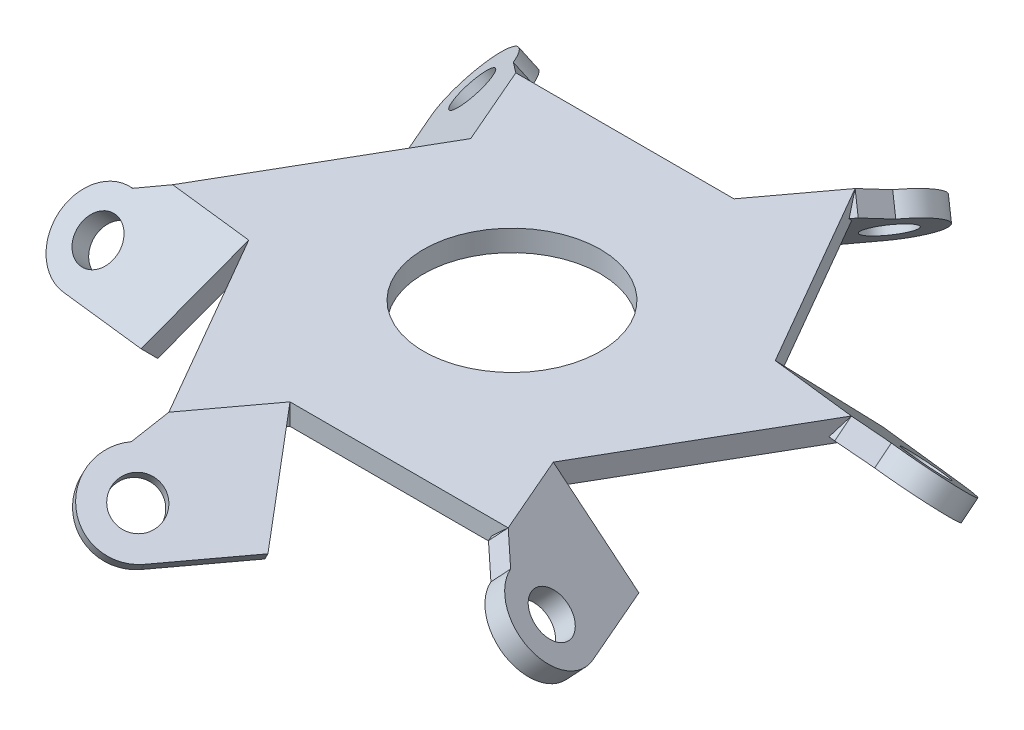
ISO-10303-21;
HEADER;
FILE_DESCRIPTION(('STEP AP214'),'2;1');
FILE_NAME('part.step','',(''),(''),'','','');
FILE_SCHEMA(('AUTOMOTIVE_DESIGN { 1 0 10303 214 1 1 1 1 }'));
ENDSEC;
DATA;
#1=APPLICATION_CONTEXT('core data for automotive mechanical design processes');
#2=APPLICATION_PROTOCOL_DEFINITION('international standard','automotive_design',2000,#1);
#3=PRODUCT_CONTEXT('',#1,'mechanical');
#4=PRODUCT('Part','Part','',(#3));
#5=PRODUCT_RELATED_PRODUCT_CATEGORY('part','',(#4));
#6=PRODUCT_DEFINITION_FORMATION('','',#4);
#7=PRODUCT_DEFINITION_CONTEXT('part definition',#1,'design');
#8=PRODUCT_DEFINITION('design','',#6,#7);
#9=PRODUCT_DEFINITION_SHAPE('','',#8);
#10=(LENGTH_UNIT() NAMED_UNIT(*) SI_UNIT(.MILLI.,.METRE.));
#11=(NAMED_UNIT(*) PLANE_ANGLE_UNIT() SI_UNIT($,.RADIAN.));
#12=(NAMED_UNIT(*) SI_UNIT($,.STERADIAN.) SOLID_ANGLE_UNIT());
#13=UNCERTAINTY_MEASURE_WITH_UNIT(LENGTH_MEASURE(1.E-05),#10,'distance_accuracy_value','');
#14=(GEOMETRIC_REPRESENTATION_CONTEXT(3) GLOBAL_UNCERTAINTY_ASSIGNED_CONTEXT((#13)) GLOBAL_UNIT_ASSIGNED_CONTEXT((#10,
#11,#12)) REPRESENTATION_CONTEXT('',''));
#15=CARTESIAN_POINT('',(0.,0.,0.));
#16=DIRECTION('',(0.,0.,1.));
#17=DIRECTION('',(1.,0.,0.));
#18=AXIS2_PLACEMENT_3D('',#15,#16,#17);
#19=CARTESIAN_POINT('',(18.4251395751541,-2.22169797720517,-6.70494048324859));
#20=DIRECTION('',(0.0812752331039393,0.707106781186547,-0.70242034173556));
#21=DIRECTION('',(0.,-0.704751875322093,-0.709453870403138));
#22=AXIS2_PLACEMENT_3D('',#19,#20,#21);
#23=PLANE('',#22);
#24=DIRECTION('',(-0.993372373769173,0.,-0.114940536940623));
#25=VECTOR('',#24,1.);
#26=CARTESIAN_POINT('',(19.2570466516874,0.4463692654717,-3.92281450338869));
#27=LINE('',#26,#25);
#28=CARTESIAN_POINT('',(19.2570466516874,0.4463692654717,-3.92281450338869));
#29=VERTEX_POINT('',#28);
#30=CARTESIAN_POINT('',(18.7935830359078,0.446369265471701,-3.97644067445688));
#31=VERTEX_POINT('',#30);
#32=EDGE_CURVE('E333',#29,#31,#27,.T.);
#33=ORIENTED_EDGE('',*,*,#32,.T.);
#34=DIRECTION('',(0.368377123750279,-0.676160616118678,-0.63804789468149));
#35=VECTOR('',#34,1.);
#36=CARTESIAN_POINT('',(18.7935830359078,0.446369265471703,-3.97644067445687));
#37=LINE('',#36,#35);
#38=CARTESIAN_POINT('',(19.0367681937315,0.,-4.39764972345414));
#39=VERTEX_POINT('',#38);
#40=EDGE_CURVE('E520',#31,#39,#37,.T.);
#41=ORIENTED_EDGE('',*,*,#40,.T.);
#42=DIRECTION('',(0.993372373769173,0.,0.114940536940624));
#43=VECTOR('',#42,1.);
#44=CARTESIAN_POINT('',(13.2874658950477,0.,-5.06288655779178));
#45=LINE('',#44,#43);
#46=CARTESIAN_POINT('',(13.2874658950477,0.,-5.06288655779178));
#47=VERTEX_POINT('',#46);
#48=EDGE_CURVE('E516',#47,#39,#45,.T.);
#49=ORIENTED_EDGE('',*,*,#48,.F.);
#50=DIRECTION('',(0.321362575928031,-0.685705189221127,-0.653096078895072));
#51=VECTOR('',#50,1.);
#52=CARTESIAN_POINT('',(13.2874658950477,0.,-5.06288655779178));
#53=LINE('',#52,#51);
#54=CARTESIAN_POINT('',(15.6290859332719,-4.99641567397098,-9.821694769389));
#55=VERTEX_POINT('',#54);
#56=EDGE_CURVE('E509',#47,#55,#53,.T.);
#57=ORIENTED_EDGE('',*,*,#56,.T.);
#58=DIRECTION('',(0.993372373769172,0.,0.114940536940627));
#59=VECTOR('',#58,1.);
#60=CARTESIAN_POINT('',(15.6290859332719,-4.99641567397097,-9.821694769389));
#61=LINE('',#60,#59);
#62=CARTESIAN_POINT('',(21.9370005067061,-4.99641567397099,-9.09182235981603));
#63=VERTEX_POINT('',#62);
#64=EDGE_CURVE('E326',#55,#63,#61,.T.);
#65=ORIENTED_EDGE('',*,*,#64,.T.);
#66=CARTESIAN_POINT('',(21.6789516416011,-2.75135164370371,-6.86163777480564));
#67=DIRECTION('',(0.0812752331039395,0.707106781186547,-0.70242034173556));
#68=DIRECTION('',(0.,0.704751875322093,0.709453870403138));
#69=AXIS2_PLACEMENT_3D('',#66,#67,#68);
#70=CIRCLE('',#69,3.175);
#71=CARTESIAN_POINT('',(21.4209027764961,-0.506287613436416,-4.63145318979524));
#72=VERTEX_POINT('',#71);
#73=EDGE_CURVE('E309',#63,#72,#70,.F.);
#74=ORIENTED_EDGE('',*,*,#73,.T.);
#75=DIRECTION('',(-0.876695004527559,0.385972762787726,0.287107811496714));
#76=VECTOR('',#75,1.);
#77=CARTESIAN_POINT('',(21.4209027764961,-0.506287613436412,-4.63145318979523));
#78=LINE('',#77,#76);
#79=EDGE_CURVE('E314',#72,#29,#78,.T.);
#80=ORIENTED_EDGE('',*,*,#79,.T.);
#81=EDGE_LOOP('',(#33,#41,#49,#57,#65,#74,#80));
#82=FACE_BOUND('',#81,.T.);
#83=CARTESIAN_POINT('',(21.6789516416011,-2.75135164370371,-6.86163777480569));
#84=DIRECTION('',(-0.0812752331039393,-0.707106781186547,0.70242034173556));
#85=DIRECTION('',(0.,-0.704751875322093,-0.709453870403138));
#86=AXIS2_PLACEMENT_3D('',#83,#84,#85);
#87=CIRCLE('',#86,1.5875);
#88=CARTESIAN_POINT('',(21.6789516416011,-3.87014524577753,-7.98789579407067));
#89=VERTEX_POINT('',#88);
#90=EDGE_CURVE('E39',#89,#89,#87,.T.);
#91=ORIENTED_EDGE('',*,*,#90,.F.);
#92=EDGE_LOOP('',(#91));
#93=FACE_BOUND('',#92,.T.);
#94=ADVANCED_FACE('F36',(#82,#93),#23,.F.);
#95=CARTESIAN_POINT('',(15.019218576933,-2.22169797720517,12.6041686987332));
#96=DIRECTION('',(0.648951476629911,0.707106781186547,-0.280823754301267));
#97=DIRECTION('',(-0.736754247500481,0.676160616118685,0.));
#98=AXIS2_PLACEMENT_3D('',#95,#96,#97);
#99=PLANE('',#98);
#100=DIRECTION('',(-0.397144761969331,0.,-0.917755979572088));
#101=VECTOR('',#100,1.);
#102=CARTESIAN_POINT('',(13.0257803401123,0.446369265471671,14.715684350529));
#103=LINE('',#102,#101);
#104=CARTESIAN_POINT('',(13.0257803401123,0.446369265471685,14.715684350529));
#105=VERTEX_POINT('',#104);
#106=CARTESIAN_POINT('',(12.8404901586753,0.446369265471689,14.2875));
#107=VERTEX_POINT('',#106);
#108=EDGE_CURVE('E343',#105,#107,#103,.T.);
#109=ORIENTED_EDGE('',*,*,#108,.T.);
#110=DIRECTION('',(-0.736754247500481,0.676160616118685,0.));
#111=VECTOR('',#110,1.);
#112=CARTESIAN_POINT('',(15.3522544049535,-1.85881739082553,14.2875));
#113=LINE('',#112,#111);
#114=CARTESIAN_POINT('',(13.3268604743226,0.,14.2875));
#115=VERTEX_POINT('',#114);
#116=EDGE_CURVE('E523',#107,#115,#113,.F.);
#117=ORIENTED_EDGE('',*,*,#116,.T.);
#118=DIRECTION('',(0.397144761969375,0.,0.917755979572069));
#119=VECTOR('',#118,1.);
#120=CARTESIAN_POINT('',(11.0283213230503,0.,8.97583973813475));
#121=LINE('',#120,#119);
#122=CARTESIAN_POINT('',(11.0283213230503,0.,8.97583973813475));
#123=VERTEX_POINT('',#122);
#124=EDGE_CURVE('E533',#123,#115,#121,.T.);
#125=ORIENTED_EDGE('',*,*,#124,.F.);
#126=DIRECTION('',(0.726279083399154,-0.685705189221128,-0.0482398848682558));
#127=VECTOR('',#126,1.);
#128=CARTESIAN_POINT('',(11.0283213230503,0.,8.97583973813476));
#129=LINE('',#128,#127);
#130=CARTESIAN_POINT('',(16.3203801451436,-4.99641567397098,8.62433807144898));
#131=VERTEX_POINT('',#130);
#132=EDGE_CURVE('E526',#123,#131,#129,.T.);
#133=ORIENTED_EDGE('',*,*,#132,.T.);
#134=DIRECTION('',(0.397144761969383,0.,0.917755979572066));
#135=VECTOR('',#134,1.);
#136=CARTESIAN_POINT('',(16.3203801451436,-4.99641567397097,8.62433807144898));
#137=LINE('',#136,#135);
#138=CARTESIAN_POINT('',(18.8422493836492,-4.99641567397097,14.4520885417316));
#139=VERTEX_POINT('',#138);
#140=EDGE_CURVE('E454',#131,#139,#137,.T.);
#141=ORIENTED_EDGE('',*,*,#140,.T.);
#142=CARTESIAN_POINT('',(16.7818284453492,-2.7513516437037,15.3437039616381));
#143=DIRECTION('',(0.648951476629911,0.707106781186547,-0.280823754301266));
#144=DIRECTION('',(0.736754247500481,-0.676160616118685,0.));
#145=AXIS2_PLACEMENT_3D('',#142,#143,#144);
#146=CIRCLE('',#145,3.175);
#147=CARTESIAN_POINT('',(14.7214075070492,-0.506287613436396,16.2353193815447));
#148=VERTEX_POINT('',#147);
#149=EDGE_CURVE('E334',#139,#148,#146,.F.);
#150=ORIENTED_EDGE('',*,*,#149,.T.);
#151=DIRECTION('',(-0.686990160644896,0.385972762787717,-0.61568623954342));
#152=VECTOR('',#151,1.);
#153=CARTESIAN_POINT('',(14.7214075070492,-0.506287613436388,16.2353193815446));
#154=LINE('',#153,#152);
#155=EDGE_CURVE('E460',#148,#105,#154,.T.);
#156=ORIENTED_EDGE('',*,*,#155,.T.);
#157=EDGE_LOOP('',(#109,#117,#125,#133,#141,#150,#156));
#158=FACE_BOUND('',#157,.T.);
#159=CARTESIAN_POINT('',(16.7818284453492,-2.75135164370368,15.3437039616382));
#160=DIRECTION('',(-0.648951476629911,-0.707106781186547,0.280823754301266));
#161=DIRECTION('',(-0.736754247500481,0.676160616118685,0.));
#162=AXIS2_PLACEMENT_3D('',#159,#160,#161);
#163=CIRCLE('',#162,1.5875);
#164=CARTESIAN_POINT('',(15.6122310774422,-1.67794666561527,15.3437039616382));
#165=VERTEX_POINT('',#164);
#166=EDGE_CURVE('E329',#165,#165,#163,.T.);
#167=ORIENTED_EDGE('',*,*,#166,.F.);
#168=EDGE_LOOP('',(#167));
#169=FACE_BOUND('',#168,.T.);
#170=ADVANCED_FACE('F1105',(#158,#169),#99,.F.);
#171=CARTESIAN_POINT('',(-3.40592099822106,-2.22169797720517,19.3091091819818));
#172=DIRECTION('',(0.567676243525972,0.707106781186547,0.421596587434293));
#173=DIRECTION('',(-0.779796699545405,0.626032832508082,0.));
#174=AXIS2_PLACEMENT_3D('',#171,#172,#173);
#175=PLANE('',#174);
#176=DIRECTION('',(0.596227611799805,0.,-0.802815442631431));
#177=VECTOR('',#176,1.);
#178=CARTESIAN_POINT('',(-6.23126631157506,0.446369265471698,18.6384988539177));
#179=LINE('',#178,#177);
#180=CARTESIAN_POINT('',(-6.23126631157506,0.4463692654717,18.6384988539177));
#181=VERTEX_POINT('',#180);
#182=CARTESIAN_POINT('',(-5.95309287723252,0.446369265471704,18.2639406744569));
#183=VERTEX_POINT('',#182);
#184=EDGE_CURVE('E353',#181,#183,#179,.T.);
#185=ORIENTED_EDGE('',*,*,#184,.T.);
#186=DIRECTION('',(0.368377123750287,-0.676160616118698,0.638047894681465));
#187=VECTOR('',#186,1.);
#188=CARTESIAN_POINT('',(-5.95309287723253,0.446369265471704,18.2639406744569));
#189=LINE('',#188,#187);
#190=CARTESIAN_POINT('',(-5.70990771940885,0.,18.6851497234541));
#191=VERTEX_POINT('',#190);
#192=EDGE_CURVE('E539',#183,#191,#189,.T.);
#193=ORIENTED_EDGE('',*,*,#192,.T.);
#194=DIRECTION('',(-0.59622761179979,0.,0.802815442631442));
#195=VECTOR('',#194,1.);
#196=CARTESIAN_POINT('',(-2.25914457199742,0.,14.0387262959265));
#197=LINE('',#196,#195);
#198=CARTESIAN_POINT('',(-2.25914457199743,0.,14.0387262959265));
#199=VERTEX_POINT('',#198);
#200=EDGE_CURVE('E549',#199,#191,#197,.T.);
#201=ORIENTED_EDGE('',*,*,#200,.F.);
#202=DIRECTION('',(0.404916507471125,-0.685705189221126,0.604856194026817));
#203=VECTOR('',#202,1.);
#204=CARTESIAN_POINT('',(-2.25914457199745,0.,14.0387262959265));
#205=LINE('',#204,#203);
#206=CARTESIAN_POINT('',(0.691294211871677,-4.996415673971,18.446032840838));
#207=VERTEX_POINT('',#206);
#208=EDGE_CURVE('E542',#199,#207,#205,.T.);
#209=ORIENTED_EDGE('',*,*,#208,.T.);
#210=DIRECTION('',(-0.596227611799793,0.,0.80281544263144));
#211=VECTOR('',#210,1.);
#212=CARTESIAN_POINT('',(0.69129421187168,-4.99641567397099,18.446032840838));
#213=LINE('',#212,#211);
#214=CARTESIAN_POINT('',(-3.094751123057,-4.99641567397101,23.5439109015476));
#215=VERTEX_POINT('',#214);
#216=EDGE_CURVE('E466',#207,#215,#213,.T.);
#217=ORIENTED_EDGE('',*,*,#216,.T.);
#218=CARTESIAN_POINT('',(-4.89712319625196,-2.75135164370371,22.2053417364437));
#219=DIRECTION('',(0.567676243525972,0.707106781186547,0.421596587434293));
#220=DIRECTION('',(0.779796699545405,-0.626032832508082,0.));
#221=AXIS2_PLACEMENT_3D('',#218,#219,#220);
#222=CIRCLE('',#221,3.175);
#223=CARTESIAN_POINT('',(-6.69949526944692,-0.506287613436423,20.8667725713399));
#224=VERTEX_POINT('',#223);
#225=EDGE_CURVE('E344',#215,#224,#222,.F.);
#226=ORIENTED_EDGE('',*,*,#225,.T.);
#227=DIRECTION('',(0.18970484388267,0.385972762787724,-0.902794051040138));
#228=VECTOR('',#227,1.);
#229=CARTESIAN_POINT('',(-6.69949526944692,-0.506287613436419,20.8667725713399));
#230=LINE('',#229,#228);
#231=EDGE_CURVE('E472',#224,#181,#230,.T.);
#232=ORIENTED_EDGE('',*,*,#231,.T.);
#233=EDGE_LOOP('',(#185,#193,#201,#209,#217,#226,#232));
#234=FACE_BOUND('',#233,.T.);
#235=CARTESIAN_POINT('',(-4.89712319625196,-2.75135164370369,22.2053417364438));
#236=DIRECTION('',(-0.567676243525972,-0.707106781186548,-0.421596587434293));
#237=DIRECTION('',(-0.779796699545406,0.626032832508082,0.));
#238=AXIS2_PLACEMENT_3D('',#235,#236,#237);
#239=CIRCLE('',#238,1.5875);
#240=CARTESIAN_POINT('',(-6.13505045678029,-1.75752452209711,22.2053417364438));
#241=VERTEX_POINT('',#240);
#242=EDGE_CURVE('E339',#241,#241,#239,.T.);
#243=ORIENTED_EDGE('',*,*,#242,.F.);
#244=EDGE_LOOP('',(#243));
#245=FACE_BOUND('',#244,.T.);
#246=ADVANCED_FACE('F1109',(#234,#245),#175,.F.);
#247=CARTESIAN_POINT('',(-18.4251395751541,-2.22169797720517,6.7049404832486));
#248=DIRECTION('',(-0.0812752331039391,0.707106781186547,0.70242034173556));
#249=DIRECTION('',(0.,0.704751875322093,-0.709453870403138));
#250=AXIS2_PLACEMENT_3D('',#247,#248,#249);
#251=PLANE('',#250);
#252=DIRECTION('',(0.993372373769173,0.,0.114940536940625));
#253=VECTOR('',#252,1.);
#254=CARTESIAN_POINT('',(-19.2570466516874,0.446369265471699,3.9228145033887));
#255=LINE('',#254,#253);
#256=CARTESIAN_POINT('',(-19.2570466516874,0.446369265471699,3.9228145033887));
#257=VERTEX_POINT('',#256);
#258=CARTESIAN_POINT('',(-18.7935830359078,0.446369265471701,3.97644067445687));
#259=VERTEX_POINT('',#258);
#260=EDGE_CURVE('E363',#257,#259,#255,.T.);
#261=ORIENTED_EDGE('',*,*,#260,.T.);
#262=DIRECTION('',(-0.368377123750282,-0.676160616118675,0.638047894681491));
#263=VECTOR('',#262,1.);
#264=CARTESIAN_POINT('',(-18.7935830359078,0.446369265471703,3.97644067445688));
#265=LINE('',#264,#263);
#266=CARTESIAN_POINT('',(-19.0367681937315,0.,4.39764972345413));
#267=VERTEX_POINT('',#266);
#268=EDGE_CURVE('E555',#259,#267,#265,.T.);
#269=ORIENTED_EDGE('',*,*,#268,.T.);
#270=DIRECTION('',(-0.993372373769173,0.,-0.114940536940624));
#271=VECTOR('',#270,1.);
#272=CARTESIAN_POINT('',(-13.2874658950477,0.,5.06288655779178));
#273=LINE('',#272,#271);
#274=CARTESIAN_POINT('',(-13.2874658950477,0.,5.06288655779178));
#275=VERTEX_POINT('',#274);
#276=EDGE_CURVE('E565',#275,#267,#273,.T.);
#277=ORIENTED_EDGE('',*,*,#276,.F.);
#278=DIRECTION('',(-0.321362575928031,-0.685705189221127,0.653096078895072));
#279=VECTOR('',#278,1.);
#280=CARTESIAN_POINT('',(-13.2874658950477,0.,5.06288655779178));
#281=LINE('',#280,#279);
#282=CARTESIAN_POINT('',(-15.6290859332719,-4.99641567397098,9.821694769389));
#283=VERTEX_POINT('',#282);
#284=EDGE_CURVE('E558',#275,#283,#281,.T.);
#285=ORIENTED_EDGE('',*,*,#284,.T.);
#286=DIRECTION('',(-0.993372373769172,0.,-0.114940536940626));
#287=VECTOR('',#286,1.);
#288=CARTESIAN_POINT('',(-15.6290859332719,-4.99641567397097,9.821694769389));
#289=LINE('',#288,#287);
#290=CARTESIAN_POINT('',(-21.9370005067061,-4.99641567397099,9.09182235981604));
#291=VERTEX_POINT('',#290);
#292=EDGE_CURVE('E478',#283,#291,#289,.T.);
#293=ORIENTED_EDGE('',*,*,#292,.T.);
#294=CARTESIAN_POINT('',(-21.6789516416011,-2.75135164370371,6.86163777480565));
#295=DIRECTION('',(-0.0812752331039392,0.707106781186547,0.70242034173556));
#296=DIRECTION('',(0.,-0.704751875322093,0.709453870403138));
#297=AXIS2_PLACEMENT_3D('',#294,#295,#296);
#298=CIRCLE('',#297,3.175);
#299=CARTESIAN_POINT('',(-21.4209027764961,-0.506287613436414,4.63145318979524));
#300=VERTEX_POINT('',#299);
#301=EDGE_CURVE('E354',#291,#300,#298,.F.);
#302=ORIENTED_EDGE('',*,*,#301,.T.);
#303=DIRECTION('',(0.876695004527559,0.385972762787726,-0.287107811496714));
#304=VECTOR('',#303,1.);
#305=CARTESIAN_POINT('',(-21.4209027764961,-0.506287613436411,4.63145318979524));
#306=LINE('',#305,#304);
#307=EDGE_CURVE('E484',#300,#257,#306,.T.);
#308=ORIENTED_EDGE('',*,*,#307,.T.);
#309=EDGE_LOOP('',(#261,#269,#277,#285,#293,#302,#308));
#310=FACE_BOUND('',#309,.T.);
#311=CARTESIAN_POINT('',(-21.6789516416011,-2.75135164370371,6.86163777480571));
#312=DIRECTION('',(0.0812752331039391,-0.707106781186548,-0.70242034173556));
#313=DIRECTION('',(0.,0.704751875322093,-0.709453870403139));
#314=AXIS2_PLACEMENT_3D('',#311,#312,#313);
#315=CIRCLE('',#314,1.5875);
#316=CARTESIAN_POINT('',(-21.6789516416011,-1.63255804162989,5.73537975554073));
#317=VERTEX_POINT('',#316);
#318=EDGE_CURVE('E349',#317,#317,#315,.T.);
#319=ORIENTED_EDGE('',*,*,#318,.F.);
#320=EDGE_LOOP('',(#319));
#321=FACE_BOUND('',#320,.T.);
#322=ADVANCED_FACE('F1114',(#310,#321),#251,.F.);
#323=CARTESIAN_POINT('',(-15.0192185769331,-2.22169797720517,-12.6041686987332));
#324=DIRECTION('',(-0.648951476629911,0.707106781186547,0.280823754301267));
#325=DIRECTION('',(-0.736754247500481,-0.676160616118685,0.));
#326=AXIS2_PLACEMENT_3D('',#323,#324,#325);
#327=PLANE('',#326);
#328=DIRECTION('',(0.397144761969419,0.,0.91775597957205));
#329=VECTOR('',#328,1.);
#330=CARTESIAN_POINT('',(-13.0257803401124,0.446369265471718,-14.715684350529));
#331=LINE('',#330,#329);
#332=CARTESIAN_POINT('',(-13.0257803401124,0.446369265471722,-14.715684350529));
#333=VERTEX_POINT('',#332);
#334=CARTESIAN_POINT('',(-12.8404901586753,0.446369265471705,-14.2875));
#335=VERTEX_POINT('',#334);
#336=EDGE_CURVE('E611',#333,#335,#331,.T.);
#337=ORIENTED_EDGE('',*,*,#336,.T.);
#338=DIRECTION('',(-0.736754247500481,-0.676160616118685,0.));
#339=VECTOR('',#338,1.);
#340=CARTESIAN_POINT('',(-15.3522544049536,-1.85881739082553,-14.2875));
#341=LINE('',#340,#339);
#342=CARTESIAN_POINT('',(-13.3268604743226,0.,-14.2875));
#343=VERTEX_POINT('',#342);
#344=EDGE_CURVE('E506',#335,#343,#341,.T.);
#345=ORIENTED_EDGE('',*,*,#344,.T.);
#346=DIRECTION('',(-0.397144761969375,0.,-0.917755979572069));
#347=VECTOR('',#346,1.);
#348=CARTESIAN_POINT('',(-11.0283213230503,0.,-8.97583973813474));
#349=LINE('',#348,#347);
#350=CARTESIAN_POINT('',(-11.0283213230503,0.,-8.97583973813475));
#351=VERTEX_POINT('',#350);
#352=EDGE_CURVE('E580',#351,#343,#349,.T.);
#353=ORIENTED_EDGE('',*,*,#352,.F.);
#354=DIRECTION('',(-0.726279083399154,-0.685705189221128,0.0482398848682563));
#355=VECTOR('',#354,1.);
#356=CARTESIAN_POINT('',(-11.0283213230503,0.,-8.97583973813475));
#357=LINE('',#356,#355);
#358=CARTESIAN_POINT('',(-16.3203801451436,-4.99641567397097,-8.62433807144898));
#359=VERTEX_POINT('',#358);
#360=EDGE_CURVE('E573',#351,#359,#357,.T.);
#361=ORIENTED_EDGE('',*,*,#360,.T.);
#362=DIRECTION('',(-0.397144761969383,0.,-0.917755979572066));
#363=VECTOR('',#362,1.);
#364=CARTESIAN_POINT('',(-16.3203801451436,-4.99641567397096,-8.62433807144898));
#365=LINE('',#364,#363);
#366=CARTESIAN_POINT('',(-18.8422493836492,-4.99641567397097,-14.4520885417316));
#367=VERTEX_POINT('',#366);
#368=EDGE_CURVE('E490',#359,#367,#365,.T.);
#369=ORIENTED_EDGE('',*,*,#368,.T.);
#370=CARTESIAN_POINT('',(-16.7818284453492,-2.7513516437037,-15.3437039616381));
#371=DIRECTION('',(-0.648951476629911,0.707106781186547,0.280823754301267));
#372=DIRECTION('',(0.736754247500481,0.676160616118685,0.));
#373=AXIS2_PLACEMENT_3D('',#370,#371,#372);
#374=CIRCLE('',#373,3.175);
#375=CARTESIAN_POINT('',(-14.7214075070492,-0.50628761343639,-16.2353193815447));
#376=VERTEX_POINT('',#375);
#377=EDGE_CURVE('E364',#367,#376,#374,.F.);
#378=ORIENTED_EDGE('',*,*,#377,.T.);
#379=DIRECTION('',(0.686990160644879,0.385972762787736,0.615686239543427));
#380=VECTOR('',#379,1.);
#381=CARTESIAN_POINT('',(-14.7214075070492,-0.506287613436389,-16.2353193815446));
#382=LINE('',#381,#380);
#383=EDGE_CURVE('E496',#376,#333,#382,.T.);
#384=ORIENTED_EDGE('',*,*,#383,.T.);
#385=EDGE_LOOP('',(#337,#345,#353,#361,#369,#378,#384));
#386=FACE_BOUND('',#385,.T.);
#387=CARTESIAN_POINT('',(-16.7818284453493,-2.75135164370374,-15.3437039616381));
#388=DIRECTION('',(0.648951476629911,-0.707106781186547,-0.280823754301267));
#389=DIRECTION('',(-0.736754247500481,-0.676160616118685,0.));
#390=AXIS2_PLACEMENT_3D('',#387,#388,#389);
#391=CIRCLE('',#390,1.5875);
#392=CARTESIAN_POINT('',(-17.9514258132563,-3.82475662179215,-15.3437039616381));
#393=VERTEX_POINT('',#392);
#394=EDGE_CURVE('E359',#393,#393,#391,.T.);
#395=ORIENTED_EDGE('',*,*,#394,.F.);
#396=EDGE_LOOP('',(#395));
#397=FACE_BOUND('',#396,.T.);
#398=ADVANCED_FACE('F1080',(#386,#397),#327,.F.);
#399=CARTESIAN_POINT('',(3.40592099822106,-2.22169797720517,-19.3091091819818));
#400=DIRECTION('',(-0.567676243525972,0.707106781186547,-0.421596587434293));
#401=DIRECTION('',(-0.779796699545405,-0.626032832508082,0.));
#402=AXIS2_PLACEMENT_3D('',#399,#400,#401);
#403=PLANE('',#402);
#404=DIRECTION('',(-0.36837712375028,-0.676160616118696,-0.63804789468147));
#405=VECTOR('',#404,1.);
#406=CARTESIAN_POINT('',(5.95309287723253,0.446369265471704,-18.2639406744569));
#407=LINE('',#406,#405);
#408=CARTESIAN_POINT('',(5.95309287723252,0.446369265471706,-18.2639406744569));
#409=VERTEX_POINT('',#408);
#410=CARTESIAN_POINT('',(5.70990771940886,0.,-18.6851497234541));
#411=VERTEX_POINT('',#410);
#412=EDGE_CURVE('E502',#409,#411,#407,.T.);
#413=ORIENTED_EDGE('',*,*,#412,.T.);
#414=DIRECTION('',(0.596227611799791,0.,-0.802815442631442));
#415=VECTOR('',#414,1.);
#416=CARTESIAN_POINT('',(2.25914457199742,0.,-14.0387262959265));
#417=LINE('',#416,#415);
#418=CARTESIAN_POINT('',(2.25914457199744,0.,-14.0387262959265));
#419=VERTEX_POINT('',#418);
#420=EDGE_CURVE('E608',#419,#411,#417,.T.);
#421=ORIENTED_EDGE('',*,*,#420,.F.);
#422=DIRECTION('',(-0.404916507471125,-0.685705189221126,-0.604856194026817));
#423=VECTOR('',#422,1.);
#424=CARTESIAN_POINT('',(2.25914457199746,0.,-14.0387262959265));
#425=LINE('',#424,#423);
#426=CARTESIAN_POINT('',(-0.691294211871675,-4.996415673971,-18.446032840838));
#427=VERTEX_POINT('',#426);
#428=EDGE_CURVE('E589',#419,#427,#425,.T.);
#429=ORIENTED_EDGE('',*,*,#428,.T.);
#430=DIRECTION('',(0.596227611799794,0.,-0.80281544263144));
#431=VECTOR('',#430,1.);
#432=CARTESIAN_POINT('',(-0.691294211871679,-4.996415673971,-18.446032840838));
#433=LINE('',#432,#431);
#434=CARTESIAN_POINT('',(3.09475112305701,-4.99641567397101,-23.5439109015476));
#435=VERTEX_POINT('',#434);
#436=EDGE_CURVE('E597',#427,#435,#433,.T.);
#437=ORIENTED_EDGE('',*,*,#436,.T.);
#438=CARTESIAN_POINT('',(4.89712319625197,-2.75135164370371,-22.2053417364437));
#439=DIRECTION('',(-0.567676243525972,0.707106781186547,-0.421596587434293));
#440=DIRECTION('',(0.779796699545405,0.626032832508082,0.));
#441=AXIS2_PLACEMENT_3D('',#438,#439,#440);
#442=CIRCLE('',#441,3.175);
#443=CARTESIAN_POINT('',(6.69949526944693,-0.506287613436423,-20.8667725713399));
#444=VERTEX_POINT('',#443);
#445=EDGE_CURVE('E374',#435,#444,#442,.F.);
#446=ORIENTED_EDGE('',*,*,#445,.T.);
#447=DIRECTION('',(-0.18970484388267,0.385972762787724,0.902794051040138));
#448=VECTOR('',#447,1.);
#449=CARTESIAN_POINT('',(6.69949526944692,-0.506287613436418,-20.8667725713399));
#450=LINE('',#449,#448);
#451=CARTESIAN_POINT('',(6.23126631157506,0.446369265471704,-18.6384988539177));
#452=VERTEX_POINT('',#451);
#453=EDGE_CURVE('E603',#444,#452,#450,.T.);
#454=ORIENTED_EDGE('',*,*,#453,.T.);
#455=DIRECTION('',(-0.596227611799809,0.,0.802815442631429));
#456=VECTOR('',#455,1.);
#457=CARTESIAN_POINT('',(6.23126631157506,0.446369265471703,-18.6384988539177));
#458=LINE('',#457,#456);
#459=EDGE_CURVE('E505',#452,#409,#458,.T.);
#460=ORIENTED_EDGE('',*,*,#459,.T.);
#461=EDGE_LOOP('',(#413,#421,#429,#437,#446,#454,#460));
#462=FACE_BOUND('',#461,.T.);
#463=CARTESIAN_POINT('',(4.89712319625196,-2.75135164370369,-22.2053417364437));
#464=DIRECTION('',(0.567676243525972,-0.707106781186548,0.421596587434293));
#465=DIRECTION('',(-0.779796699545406,-0.626032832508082,0.));
#466=AXIS2_PLACEMENT_3D('',#463,#464,#465);
#467=CIRCLE('',#466,1.5875);
#468=CARTESIAN_POINT('',(3.65919593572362,-3.74517876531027,-22.2053417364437));
#469=VERTEX_POINT('',#468);
#470=EDGE_CURVE('E369',#469,#469,#467,.T.);
#471=ORIENTED_EDGE('',*,*,#470,.F.);
#472=EDGE_LOOP('',(#471));
#473=FACE_BOUND('',#472,.T.);
#474=ADVANCED_FACE('F959',(#462,#473),#403,.F.);
#475=CARTESIAN_POINT('',(19.3806839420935,1.524,-4.99332927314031));
#476=DIRECTION('',(0.114940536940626,0.,-0.993372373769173));
#477=DIRECTION('',(0.993372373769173,0.,0.114940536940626));
#478=AXIS2_PLACEMENT_3D('',#475,#476,#477);
#479=PLANE('',#478);
#480=DIRECTION('',(0.,1.,0.));
#481=VECTOR('',#480,1.);
#482=CARTESIAN_POINT('',(13.2021339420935,0.,-5.70823324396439));
#483=LINE('',#482,#481);
#484=CARTESIAN_POINT('',(13.2021339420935,0.,-5.70823324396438));
#485=VERTEX_POINT('',#484);
#486=CARTESIAN_POINT('',(13.2021339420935,1.524,-5.70823324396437));
#487=VERTEX_POINT('',#486);
#488=EDGE_CURVE('E619',#485,#487,#483,.T.);
#489=ORIENTED_EDGE('',*,*,#488,.T.);
#490=DIRECTION('',(0.174121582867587,-0.98451803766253,0.0201471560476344));
#491=VECTOR('',#490,1.);
#492=CARTESIAN_POINT('',(13.2021339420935,1.52400000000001,-5.70823324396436));
#493=LINE('',#492,#491);
#494=CARTESIAN_POINT('',(13.4716681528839,0.,-5.67704614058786));
#495=VERTEX_POINT('',#494);
#496=EDGE_CURVE('E511',#487,#495,#493,.T.);
#497=ORIENTED_EDGE('',*,*,#496,.T.);
#498=DIRECTION('',(0.993372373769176,0.,0.114940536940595));
#499=VECTOR('',#498,1.);
#500=CARTESIAN_POINT('',(13.2021339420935,0.,-5.70823324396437));
#501=LINE('',#500,#499);
#502=EDGE_CURVE('E517',#485,#495,#501,.T.);
#503=ORIENTED_EDGE('',*,*,#502,.F.);
#504=EDGE_LOOP('',(#489,#497,#503));
#505=FACE_BOUND('',#504,.T.);
#506=ADVANCED_FACE('F1073',(#505),#479,.T.);
#507=CARTESIAN_POINT('',(1.65759197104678,1.524,-14.2875));
#508=DIRECTION('',(0.567676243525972,0.707106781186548,0.421596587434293));
#509=DIRECTION('',(-0.779796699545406,0.626032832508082,0.));
#510=AXIS2_PLACEMENT_3D('',#507,#508,#509);
#511=PLANE('',#510);
#512=DIRECTION('',(-0.567676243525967,0.707106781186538,-0.421596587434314));
#513=VECTOR('',#512,1.);
#514=CARTESIAN_POINT('',(6.23126631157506,0.446369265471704,-18.6384988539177));
#515=LINE('',#514,#513);
#516=CARTESIAN_POINT('',(5.36605984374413,1.524,-19.2809206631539));
#517=VERTEX_POINT('',#516);
#518=EDGE_CURVE('E383',#452,#517,#515,.T.);
#519=ORIENTED_EDGE('',*,*,#518,.T.);
#520=DIRECTION('',(0.368377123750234,-0.676160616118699,0.638047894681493));
#521=VECTOR('',#520,1.);
#522=CARTESIAN_POINT('',(5.36599197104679,1.524,-19.2808292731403));
#523=LINE('',#522,#521);
#524=EDGE_CURVE('E388',#517,#409,#523,.T.);
#525=ORIENTED_EDGE('',*,*,#524,.T.);
#526=ORIENTED_EDGE('',*,*,#459,.F.);
#527=EDGE_LOOP('',(#519,#525,#526));
#528=FACE_BOUND('',#527,.T.);
#529=ADVANCED_FACE('F957',(#528),#511,.T.);
#530=CARTESIAN_POINT('',(15.9512950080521,-52.5828278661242,42.6395740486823));
#531=DIRECTION('',(0.0812752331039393,0.707106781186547,-0.70242034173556));
#532=DIRECTION('',(0.,-0.704751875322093,-0.709453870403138));
#533=AXIS2_PLACEMENT_3D('',#530,#531,#532);
#534=CYLINDRICAL_SURFACE('',#533,1.5875);
#535=CARTESIAN_POINT('',(21.8028150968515,-1.67372090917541,-7.93212637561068));
#536=DIRECTION('',(-0.0812752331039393,-0.707106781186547,0.70242034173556));
#537=DIRECTION('',(0.,-0.704751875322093,-0.709453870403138));
#538=AXIS2_PLACEMENT_3D('',#535,#536,#537);
#539=CIRCLE('',#538,1.5875);
#540=CARTESIAN_POINT('',(21.8028150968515,-2.79251451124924,-9.05838439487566));
#541=VERTEX_POINT('',#540);
#542=EDGE_CURVE('E384',#541,#541,#539,.F.);
#543=ORIENTED_EDGE('',*,*,#542,.T.);
#544=EDGE_LOOP('',(#543));
#545=FACE_BOUND('',#544,.T.);
#546=ORIENTED_EDGE('',*,*,#90,.T.);
#547=EDGE_LOOP('',(#546));
#548=FACE_BOUND('',#547,.T.);
#549=ADVANCED_FACE('F1130',(#545,#548),#534,.F.);
#550=CARTESIAN_POINT('',(15.7529493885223,-3.9187849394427,-10.892183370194));
#551=DIRECTION('',(-0.943461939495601,-0.172651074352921,-0.282968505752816));
#552=DIRECTION('',(0.287282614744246,0.,-0.957845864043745));
#553=AXIS2_PLACEMENT_3D('',#550,#551,#552);
#554=PLANE('',#553);
#555=DIRECTION('',(-0.0812752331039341,-0.707106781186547,0.70242034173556));
#556=VECTOR('',#555,1.);
#557=CARTESIAN_POINT('',(15.7529493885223,-3.91878493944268,-10.892183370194));
#558=LINE('',#557,#556);
#559=CARTESIAN_POINT('',(15.7529493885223,-3.91878493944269,-10.892183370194));
#560=VERTEX_POINT('',#559);
#561=EDGE_CURVE('E449',#560,#55,#558,.T.);
#562=ORIENTED_EDGE('',*,*,#561,.T.);
#563=ORIENTED_EDGE('',*,*,#56,.F.);
#564=DIRECTION('',(-0.287282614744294,0.,0.957845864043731));
#565=VECTOR('',#564,1.);
#566=CARTESIAN_POINT('',(13.4716681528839,0.,-5.67704614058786));
#567=LINE('',#566,#565);
#568=EDGE_CURVE('E514',#495,#47,#567,.T.);
#569=ORIENTED_EDGE('',*,*,#568,.F.);
#570=ORIENTED_EDGE('',*,*,#496,.F.);
#571=DIRECTION('',(0.321362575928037,-0.685705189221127,-0.65309607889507));
#572=VECTOR('',#571,1.);
#573=CARTESIAN_POINT('',(13.2021339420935,1.52400000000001,-5.70823324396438));
#574=LINE('',#573,#572);
#575=EDGE_CURVE('E387',#487,#560,#574,.T.);
#576=ORIENTED_EDGE('',*,*,#575,.T.);
#577=EDGE_LOOP('',(#562,#563,#569,#570,#576));
#578=FACE_BOUND('',#577,.T.);
#579=ADVANCED_FACE('F1069',(#578),#554,.T.);
#580=CARTESIAN_POINT('',(22.0608639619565,-3.9187849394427,-10.162310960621));
#581=DIRECTION('',(0.0812752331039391,-0.707106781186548,-0.70242034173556));
#582=DIRECTION('',(0.,-0.704751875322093,0.709453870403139));
#583=AXIS2_PLACEMENT_3D('',#580,#581,#582);
#584=PLANE('',#583);
#585=ORIENTED_EDGE('',*,*,#64,.F.);
#586=ORIENTED_EDGE('',*,*,#561,.F.);
#587=DIRECTION('',(0.993372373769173,0.,0.114940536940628));
#588=VECTOR('',#587,1.);
#589=CARTESIAN_POINT('',(15.7529493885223,-3.91878493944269,-10.892183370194));
#590=LINE('',#589,#588);
#591=CARTESIAN_POINT('',(22.0608639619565,-3.91878493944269,-10.162310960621));
#592=VERTEX_POINT('',#591);
#593=EDGE_CURVE('E391',#560,#592,#590,.T.);
#594=ORIENTED_EDGE('',*,*,#593,.T.);
#595=DIRECTION('',(-0.0812752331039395,-0.707106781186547,0.70242034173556));
#596=VECTOR('',#595,1.);
#597=CARTESIAN_POINT('',(22.0608639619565,-3.9187849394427,-10.162310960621));
#598=LINE('',#597,#596);
#599=EDGE_CURVE('E299',#592,#63,#598,.T.);
#600=ORIENTED_EDGE('',*,*,#599,.T.);
#601=EDGE_LOOP('',(#585,#586,#594,#600));
#602=FACE_BOUND('',#601,.T.);
#603=ADVANCED_FACE('F1136',(#602),#584,.T.);
#604=CARTESIAN_POINT('',(21.8028150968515,-1.67372090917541,-7.93212637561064));
#605=DIRECTION('',(-0.0812752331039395,-0.707106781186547,0.70242034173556));
#606=DIRECTION('',(0.,0.704751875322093,0.709453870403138));
#607=AXIS2_PLACEMENT_3D('',#604,#605,#606);
#608=CYLINDRICAL_SURFACE('',#607,3.175);
#609=ORIENTED_EDGE('',*,*,#73,.F.);
#610=ORIENTED_EDGE('',*,*,#599,.F.);
#611=CARTESIAN_POINT('',(21.8028150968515,-1.67372090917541,-7.93212637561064));
#612=DIRECTION('',(0.0812752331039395,0.707106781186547,-0.70242034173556));
#613=DIRECTION('',(0.,0.704751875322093,0.709453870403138));
#614=AXIS2_PLACEMENT_3D('',#611,#612,#613);
#615=CIRCLE('',#614,3.175);
#616=CARTESIAN_POINT('',(21.5447662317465,0.571343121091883,-5.70194179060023));
#617=VERTEX_POINT('',#616);
#618=EDGE_CURVE('E311',#592,#617,#615,.F.);
#619=ORIENTED_EDGE('',*,*,#618,.T.);
#620=DIRECTION('',(-0.0812752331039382,-0.707106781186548,0.702420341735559));
#621=VECTOR('',#620,1.);
#622=CARTESIAN_POINT('',(21.5447662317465,0.571343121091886,-5.70194179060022));
#623=LINE('',#622,#621);
#624=EDGE_CURVE('E305',#617,#72,#623,.T.);
#625=ORIENTED_EDGE('',*,*,#624,.T.);
#626=EDGE_LOOP('',(#609,#610,#619,#625));
#627=FACE_BOUND('',#626,.T.);
#628=ADVANCED_FACE('F307',(#627),#608,.T.);
#629=CARTESIAN_POINT('',(19.3809101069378,1.524,-4.99330310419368));
#630=DIRECTION('',(0.474131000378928,0.592473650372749,0.651287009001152));
#631=DIRECTION('',(0.,0.739716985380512,-0.672918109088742));
#632=AXIS2_PLACEMENT_3D('',#629,#630,#631);
#633=PLANE('',#632);
#634=ORIENTED_EDGE('',*,*,#79,.F.);
#635=ORIENTED_EDGE('',*,*,#624,.F.);
#636=DIRECTION('',(-0.876695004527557,0.385972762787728,0.287107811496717));
#637=VECTOR('',#636,1.);
#638=CARTESIAN_POINT('',(21.5447662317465,0.571343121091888,-5.70194179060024));
#639=LINE('',#638,#637);
#640=CARTESIAN_POINT('',(19.3807970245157,1.524,-4.993316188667));
#641=VERTEX_POINT('',#640);
#642=EDGE_CURVE('E390',#617,#641,#639,.T.);
#643=ORIENTED_EDGE('',*,*,#642,.T.);
#644=DIRECTION('',(-0.081275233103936,-0.707106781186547,0.70242034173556));
#645=VECTOR('',#644,1.);
#646=CARTESIAN_POINT('',(19.3809101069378,1.524,-4.99330310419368));
#647=LINE('',#646,#645);
#648=EDGE_CURVE('E319',#641,#29,#647,.T.);
#649=ORIENTED_EDGE('',*,*,#648,.T.);
#650=EDGE_LOOP('',(#634,#635,#643,#649));
#651=FACE_BOUND('',#650,.T.);
#652=ADVANCED_FACE('F317',(#651),#633,.T.);
#653=CARTESIAN_POINT('',(13.2021339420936,1.524,-5.70823324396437));
#654=DIRECTION('',(-0.0812752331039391,0.707106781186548,0.70242034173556));
#655=DIRECTION('',(0.,0.704751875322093,-0.709453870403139));
#656=AXIS2_PLACEMENT_3D('',#653,#654,#655);
#657=PLANE('',#656);
#658=ORIENTED_EDGE('',*,*,#648,.F.);
#659=DIRECTION('',(-0.368377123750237,-0.676160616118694,0.638047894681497));
#660=VECTOR('',#659,1.);
#661=CARTESIAN_POINT('',(19.3806839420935,1.524,-4.99332927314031));
#662=LINE('',#661,#660);
#663=EDGE_CURVE('E649',#641,#31,#662,.T.);
#664=ORIENTED_EDGE('',*,*,#663,.T.);
#665=ORIENTED_EDGE('',*,*,#32,.F.);
#666=EDGE_LOOP('',(#658,#664,#665));
#667=FACE_BOUND('',#666,.T.);
#668=ADVANCED_FACE('F1143',(#667),#657,.T.);
#669=CARTESIAN_POINT('',(14.0146919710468,1.524,14.2875));
#670=DIRECTION('',(0.917755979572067,0.,-0.397144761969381));
#671=DIRECTION('',(0.397144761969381,0.,0.917755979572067));
#672=AXIS2_PLACEMENT_3D('',#669,#670,#671);
#673=PLANE('',#672);
#674=DIRECTION('',(0.,1.,0.));
#675=VECTOR('',#674,1.);
#676=CARTESIAN_POINT('',(11.5445419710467,0.,8.57926675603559));
#677=LINE('',#676,#675);
#678=CARTESIAN_POINT('',(11.5445419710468,0.,8.5792667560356));
#679=VERTEX_POINT('',#678);
#680=CARTESIAN_POINT('',(11.5445419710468,1.524,8.57926675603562));
#681=VERTEX_POINT('',#680);
#682=EDGE_CURVE('E396',#679,#681,#677,.T.);
#683=ORIENTED_EDGE('',*,*,#682,.T.);
#684=DIRECTION('',(0.0696128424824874,-0.984518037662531,0.160867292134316));
#685=VECTOR('',#684,1.);
#686=CARTESIAN_POINT('',(11.5445419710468,1.52400000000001,8.57926675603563));
#687=LINE('',#686,#685);
#688=CARTESIAN_POINT('',(11.6523002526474,0.,8.82828378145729));
#689=VERTEX_POINT('',#688);
#690=EDGE_CURVE('E332',#681,#689,#687,.T.);
#691=ORIENTED_EDGE('',*,*,#690,.T.);
#692=DIRECTION('',(0.397144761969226,0.,0.917755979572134));
#693=VECTOR('',#692,1.);
#694=CARTESIAN_POINT('',(11.5445419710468,0.,8.57926675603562));
#695=LINE('',#694,#693);
#696=EDGE_CURVE('E534',#679,#689,#695,.T.);
#697=ORIENTED_EDGE('',*,*,#696,.F.);
#698=EDGE_LOOP('',(#683,#691,#697));
#699=FACE_BOUND('',#698,.T.);
#700=ADVANCED_FACE('F1058',(#699),#673,.T.);
#701=CARTESIAN_POINT('',(-28.9513068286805,-52.5828278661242,35.1340137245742));
#702=DIRECTION('',(0.648951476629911,0.707106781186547,-0.280823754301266));
#703=DIRECTION('',(-0.736754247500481,0.676160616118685,0.));
#704=AXIS2_PLACEMENT_3D('',#701,#702,#703);
#705=CYLINDRICAL_SURFACE('',#704,1.5875);
#706=CARTESIAN_POINT('',(17.7708304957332,-1.67372090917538,14.915728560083));
#707=DIRECTION('',(-0.648951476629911,-0.707106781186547,0.280823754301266));
#708=DIRECTION('',(-0.736754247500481,0.676160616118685,0.));
#709=AXIS2_PLACEMENT_3D('',#706,#707,#708);
#710=CIRCLE('',#709,1.5875);
#711=CARTESIAN_POINT('',(16.6012331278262,-0.600315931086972,14.915728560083));
#712=VERTEX_POINT('',#711);
#713=EDGE_CURVE('E392',#712,#712,#710,.F.);
#714=ORIENTED_EDGE('',*,*,#713,.T.);
#715=EDGE_LOOP('',(#714));
#716=FACE_BOUND('',#715,.T.);
#717=ORIENTED_EDGE('',*,*,#166,.T.);
#718=EDGE_LOOP('',(#717));
#719=FACE_BOUND('',#718,.T.);
#720=ADVANCED_FACE('F1149',(#716,#719),#705,.F.);
#721=CARTESIAN_POINT('',(17.3093821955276,-3.9187849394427,8.19636266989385));
#722=DIRECTION('',(-0.226673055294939,-0.172651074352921,-0.958546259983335));
#723=DIRECTION('',(0.973160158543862,0.,-0.230128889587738));
#724=AXIS2_PLACEMENT_3D('',#721,#722,#723);
#725=PLANE('',#724);
#726=DIRECTION('',(-0.648951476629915,-0.707106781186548,0.280823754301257));
#727=VECTOR('',#726,1.);
#728=CARTESIAN_POINT('',(17.3093821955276,-3.91878493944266,8.19636266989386));
#729=LINE('',#728,#727);
#730=CARTESIAN_POINT('',(17.3093821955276,-3.91878493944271,8.19636266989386));
#731=VERTEX_POINT('',#730);
#732=EDGE_CURVE('E457',#731,#131,#729,.T.);
#733=ORIENTED_EDGE('',*,*,#732,.T.);
#734=ORIENTED_EDGE('',*,*,#132,.F.);
#735=DIRECTION('',(-0.973160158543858,0.,0.230128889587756));
#736=VECTOR('',#735,1.);
#737=CARTESIAN_POINT('',(11.6523002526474,0.,8.82828378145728));
#738=LINE('',#737,#736);
#739=EDGE_CURVE('E531',#689,#123,#738,.T.);
#740=ORIENTED_EDGE('',*,*,#739,.F.);
#741=ORIENTED_EDGE('',*,*,#690,.F.);
#742=DIRECTION('',(0.726279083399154,-0.685705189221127,-0.0482398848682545));
#743=VECTOR('',#742,1.);
#744=CARTESIAN_POINT('',(11.5445419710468,1.52399999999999,8.57926675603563));
#745=LINE('',#744,#743);
#746=EDGE_CURVE('E395',#681,#731,#745,.T.);
#747=ORIENTED_EDGE('',*,*,#746,.T.);
#748=EDGE_LOOP('',(#733,#734,#740,#741,#747));
#749=FACE_BOUND('',#748,.T.);
#750=ADVANCED_FACE('F1053',(#749),#725,.T.);
#751=CARTESIAN_POINT('',(19.8312514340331,-3.9187849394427,14.0241131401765));
#752=DIRECTION('',(0.648951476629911,-0.707106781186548,-0.280823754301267));
#753=DIRECTION('',(0.736754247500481,0.676160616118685,0.));
#754=AXIS2_PLACEMENT_3D('',#751,#752,#753);
#755=PLANE('',#754);
#756=ORIENTED_EDGE('',*,*,#140,.F.);
#757=ORIENTED_EDGE('',*,*,#732,.F.);
#758=DIRECTION('',(0.397144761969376,0.,0.917755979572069));
#759=VECTOR('',#758,1.);
#760=CARTESIAN_POINT('',(17.3093821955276,-3.91878493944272,8.19636266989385));
#761=LINE('',#760,#759);
#762=CARTESIAN_POINT('',(19.8312514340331,-3.91878493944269,14.0241131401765));
#763=VERTEX_POINT('',#762);
#764=EDGE_CURVE('E401',#731,#763,#761,.T.);
#765=ORIENTED_EDGE('',*,*,#764,.T.);
#766=DIRECTION('',(-0.648951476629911,-0.707106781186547,0.280823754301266));
#767=VECTOR('',#766,1.);
#768=CARTESIAN_POINT('',(19.8312514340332,-3.9187849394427,14.0241131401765));
#769=LINE('',#768,#767);
#770=EDGE_CURVE('E338',#763,#139,#769,.T.);
#771=ORIENTED_EDGE('',*,*,#770,.T.);
#772=EDGE_LOOP('',(#756,#757,#765,#771));
#773=FACE_BOUND('',#772,.T.);
#774=ADVANCED_FACE('F1155',(#773),#755,.T.);
#775=CARTESIAN_POINT('',(17.7708304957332,-1.67372090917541,14.915728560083));
#776=DIRECTION('',(-0.648951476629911,-0.707106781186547,0.280823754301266));
#777=DIRECTION('',(0.736754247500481,-0.676160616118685,0.));
#778=AXIS2_PLACEMENT_3D('',#775,#776,#777);
#779=CYLINDRICAL_SURFACE('',#778,3.175);
#780=ORIENTED_EDGE('',*,*,#149,.F.);
#781=ORIENTED_EDGE('',*,*,#770,.F.);
#782=CARTESIAN_POINT('',(17.7708304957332,-1.67372090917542,14.915728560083));
#783=DIRECTION('',(0.648951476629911,0.707106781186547,-0.280823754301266));
#784=DIRECTION('',(0.736754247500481,-0.676160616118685,0.));
#785=AXIS2_PLACEMENT_3D('',#782,#783,#784);
#786=CIRCLE('',#785,3.175);
#787=CARTESIAN_POINT('',(15.7104095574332,0.571343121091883,15.8073439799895));
#788=VERTEX_POINT('',#787);
#789=EDGE_CURVE('E397',#763,#788,#786,.F.);
#790=ORIENTED_EDGE('',*,*,#789,.T.);
#791=DIRECTION('',(-0.648951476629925,-0.707106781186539,0.280823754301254));
#792=VECTOR('',#791,1.);
#793=CARTESIAN_POINT('',(15.7104095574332,0.571343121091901,15.8073439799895));
#794=LINE('',#793,#792);
#795=EDGE_CURVE('E337',#788,#148,#794,.T.);
#796=ORIENTED_EDGE('',*,*,#795,.T.);
#797=EDGE_LOOP('',(#780,#781,#790,#796));
#798=FACE_BOUND('',#797,.T.);
#799=ADVANCED_FACE('F1158',(#798),#779,.T.);
#800=CARTESIAN_POINT('',(14.0147823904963,1.524,14.2877089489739));
#801=DIRECTION('',(-0.326965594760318,0.592473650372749,0.736252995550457));
#802=DIRECTION('',(0.,0.779073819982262,-0.626932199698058));
#803=AXIS2_PLACEMENT_3D('',#800,#801,#802);
#804=PLANE('',#803);
#805=ORIENTED_EDGE('',*,*,#155,.F.);
#806=ORIENTED_EDGE('',*,*,#795,.F.);
#807=DIRECTION('',(-0.686990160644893,0.385972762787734,-0.615686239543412));
#808=VECTOR('',#807,1.);
#809=CARTESIAN_POINT('',(15.7104095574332,0.571343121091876,15.8073439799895));
#810=LINE('',#809,#808);
#811=CARTESIAN_POINT('',(14.0147371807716,1.524,14.2876044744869));
#812=VERTEX_POINT('',#811);
#813=EDGE_CURVE('E400',#788,#812,#810,.T.);
#814=ORIENTED_EDGE('',*,*,#813,.T.);
#815=DIRECTION('',(-0.64895147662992,-0.707106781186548,0.280823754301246));
#816=VECTOR('',#815,1.);
#817=CARTESIAN_POINT('',(14.0147823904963,1.52399999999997,14.2877089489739));
#818=LINE('',#817,#816);
#819=EDGE_CURVE('E463',#812,#105,#818,.T.);
#820=ORIENTED_EDGE('',*,*,#819,.T.);
#821=EDGE_LOOP('',(#805,#806,#814,#820));
#822=FACE_BOUND('',#821,.T.);
#823=ADVANCED_FACE('F1162',(#822),#804,.T.);
#824=CARTESIAN_POINT('',(11.5445419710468,1.524,8.57926675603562));
#825=DIRECTION('',(-0.648951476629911,0.707106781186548,0.280823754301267));
#826=DIRECTION('',(-0.736754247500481,-0.676160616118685,0.));
#827=AXIS2_PLACEMENT_3D('',#824,#825,#826);
#828=PLANE('',#827);
#829=ORIENTED_EDGE('',*,*,#819,.F.);
#830=DIRECTION('',(-0.736754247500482,-0.676160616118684,0.));
#831=VECTOR('',#830,1.);
#832=CARTESIAN_POINT('',(14.0146919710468,1.524,14.2875));
#833=LINE('',#832,#831);
#834=EDGE_CURVE('E678',#812,#107,#833,.T.);
#835=ORIENTED_EDGE('',*,*,#834,.T.);
#836=ORIENTED_EDGE('',*,*,#108,.F.);
#837=EDGE_LOOP('',(#829,#835,#836));
#838=FACE_BOUND('',#837,.T.);
#839=ADVANCED_FACE('F1166',(#838),#828,.T.);
#840=CARTESIAN_POINT('',(-5.36599197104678,1.524,19.2808292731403));
#841=DIRECTION('',(0.802815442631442,0.,0.596227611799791));
#842=DIRECTION('',(-0.596227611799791,0.,0.802815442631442));
#843=AXIS2_PLACEMENT_3D('',#840,#841,#842);
#844=PLANE('',#843);
#845=DIRECTION('',(0.,1.,0.));
#846=VECTOR('',#845,1.);
#847=CARTESIAN_POINT('',(-1.65759197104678,0.,14.2875));
#848=LINE('',#847,#846);
#849=CARTESIAN_POINT('',(-1.65759197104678,0.,14.2875));
#850=VERTEX_POINT('',#849);
#851=CARTESIAN_POINT('',(-1.65759197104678,1.524,14.2875));
#852=VERTEX_POINT('',#851);
#853=EDGE_CURVE('E406',#850,#852,#848,.T.);
#854=ORIENTED_EDGE('',*,*,#853,.T.);
#855=DIRECTION('',(-0.104508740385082,-0.984518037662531,0.140720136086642));
#856=VECTOR('',#855,1.);
#857=CARTESIAN_POINT('',(-1.6575919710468,1.524,14.2875));
#858=LINE('',#857,#856);
#859=CARTESIAN_POINT('',(-1.81936790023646,0.,14.5053299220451));
#860=VERTEX_POINT('',#859);
#861=EDGE_CURVE('E342',#852,#860,#858,.T.);
#862=ORIENTED_EDGE('',*,*,#861,.T.);
#863=DIRECTION('',(-0.59622761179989,0.,0.802815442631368));
#864=VECTOR('',#863,1.);
#865=CARTESIAN_POINT('',(-1.65759197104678,0.,14.2875));
#866=LINE('',#865,#864);
#867=EDGE_CURVE('E550',#850,#860,#866,.T.);
#868=ORIENTED_EDGE('',*,*,#867,.F.);
#869=EDGE_LOOP('',(#854,#862,#868));
#870=FACE_BOUND('',#869,.T.);
#871=ADVANCED_FACE('F1039',(#870),#844,.T.);
#872=CARTESIAN_POINT('',(-44.9026018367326,-52.5828278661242,-7.5055603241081));
#873=DIRECTION('',(0.567676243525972,0.707106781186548,0.421596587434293));
#874=DIRECTION('',(-0.779796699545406,0.626032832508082,0.));
#875=AXIS2_PLACEMENT_3D('',#872,#873,#874);
#876=CYLINDRICAL_SURFACE('',#875,1.5875);
#877=CARTESIAN_POINT('',(-4.03198460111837,-1.6737209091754,22.8478549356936));
#878=DIRECTION('',(-0.567676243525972,-0.707106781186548,-0.421596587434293));
#879=DIRECTION('',(-0.779796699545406,0.626032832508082,0.));
#880=AXIS2_PLACEMENT_3D('',#877,#878,#879);
#881=CIRCLE('',#880,1.5875);
#882=CARTESIAN_POINT('',(-5.2699118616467,-0.679893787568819,22.8478549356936));
#883=VERTEX_POINT('',#882);
#884=EDGE_CURVE('E402',#883,#883,#881,.F.);
#885=ORIENTED_EDGE('',*,*,#884,.T.);
#886=EDGE_LOOP('',(#885));
#887=FACE_BOUND('',#886,.T.);
#888=ORIENTED_EDGE('',*,*,#242,.T.);
#889=EDGE_LOOP('',(#888));
#890=FACE_BOUND('',#889,.T.);
#891=ADVANCED_FACE('F1173',(#887,#890),#876,.F.);
#892=CARTESIAN_POINT('',(1.55643280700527,-3.9187849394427,19.0885460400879));
#893=DIRECTION('',(0.716788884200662,-0.172651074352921,-0.67557775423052));
#894=DIRECTION('',(0.685877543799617,0.,0.727716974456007));
#895=AXIS2_PLACEMENT_3D('',#892,#893,#894);
#896=PLANE('',#895);
#897=DIRECTION('',(-0.567676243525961,-0.707106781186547,-0.421596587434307));
#898=VECTOR('',#897,1.);
#899=CARTESIAN_POINT('',(1.55643280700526,-3.91878493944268,19.0885460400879));
#900=LINE('',#899,#898);
#901=CARTESIAN_POINT('',(1.55643280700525,-3.91878493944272,19.0885460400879));
#902=VERTEX_POINT('',#901);
#903=EDGE_CURVE('E469',#902,#207,#900,.T.);
#904=ORIENTED_EDGE('',*,*,#903,.T.);
#905=ORIENTED_EDGE('',*,*,#208,.F.);
#906=DIRECTION('',(-0.685877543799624,0.,-0.727716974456));
#907=VECTOR('',#906,1.);
#908=CARTESIAN_POINT('',(-1.81936790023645,0.,14.5053299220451));
#909=LINE('',#908,#907);
#910=EDGE_CURVE('E547',#860,#199,#909,.T.);
#911=ORIENTED_EDGE('',*,*,#910,.F.);
#912=ORIENTED_EDGE('',*,*,#861,.F.);
#913=DIRECTION('',(0.404916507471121,-0.685705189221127,0.604856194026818));
#914=VECTOR('',#913,1.);
#915=CARTESIAN_POINT('',(-1.65759197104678,1.52399999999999,14.2875));
#916=LINE('',#915,#914);
#917=EDGE_CURVE('E405',#852,#902,#916,.T.);
#918=ORIENTED_EDGE('',*,*,#917,.T.);
#919=EDGE_LOOP('',(#904,#905,#911,#912,#918));
#920=FACE_BOUND('',#919,.T.);
#921=ADVANCED_FACE('F1034',(#920),#896,.T.);
#922=CARTESIAN_POINT('',(-2.22961252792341,-3.9187849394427,24.1864241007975));
#923=DIRECTION('',(0.567676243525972,-0.707106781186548,0.421596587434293));
#924=DIRECTION('',(0.779796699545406,0.626032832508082,0.));
#925=AXIS2_PLACEMENT_3D('',#922,#923,#924);
#926=PLANE('',#925);
#927=ORIENTED_EDGE('',*,*,#216,.F.);
#928=ORIENTED_EDGE('',*,*,#903,.F.);
#929=DIRECTION('',(-0.596227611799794,0.,0.80281544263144));
#930=VECTOR('',#929,1.);
#931=CARTESIAN_POINT('',(1.55643280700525,-3.91878493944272,19.0885460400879));
#932=LINE('',#931,#930);
#933=CARTESIAN_POINT('',(-2.22961252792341,-3.91878493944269,24.1864241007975));
#934=VERTEX_POINT('',#933);
#935=EDGE_CURVE('E411',#902,#934,#932,.T.);
#936=ORIENTED_EDGE('',*,*,#935,.T.);
#937=DIRECTION('',(-0.567676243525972,-0.707106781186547,-0.421596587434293));
#938=VECTOR('',#937,1.);
#939=CARTESIAN_POINT('',(-2.22961252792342,-3.9187849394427,24.1864241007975));
#940=LINE('',#939,#938);
#941=EDGE_CURVE('E348',#934,#215,#940,.T.);
#942=ORIENTED_EDGE('',*,*,#941,.T.);
#943=EDGE_LOOP('',(#927,#928,#936,#942));
#944=FACE_BOUND('',#943,.T.);
#945=ADVANCED_FACE('F1179',(#944),#926,.T.);
#946=CARTESIAN_POINT('',(-4.03198460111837,-1.67372090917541,22.8478549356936));
#947=DIRECTION('',(-0.567676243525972,-0.707106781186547,-0.421596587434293));
#948=DIRECTION('',(0.779796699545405,-0.626032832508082,0.));
#949=AXIS2_PLACEMENT_3D('',#946,#947,#948);
#950=CYLINDRICAL_SURFACE('',#949,3.175);
#951=ORIENTED_EDGE('',*,*,#225,.F.);
#952=ORIENTED_EDGE('',*,*,#941,.F.);
#953=CARTESIAN_POINT('',(-4.03198460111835,-1.67372090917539,22.8478549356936));
#954=DIRECTION('',(0.567676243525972,0.707106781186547,0.421596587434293));
#955=DIRECTION('',(0.779796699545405,-0.626032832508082,0.));
#956=AXIS2_PLACEMENT_3D('',#953,#954,#955);
#957=CIRCLE('',#956,3.175);
#958=CARTESIAN_POINT('',(-5.83435667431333,0.57134312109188,21.5092857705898));
#959=VERTEX_POINT('',#958);
#960=EDGE_CURVE('E407',#934,#959,#957,.F.);
#961=ORIENTED_EDGE('',*,*,#960,.T.);
#962=DIRECTION('',(-0.567676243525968,-0.70710678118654,-0.421596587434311));
#963=VECTOR('',#962,1.);
#964=CARTESIAN_POINT('',(-5.83435667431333,0.571343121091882,21.5092857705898));
#965=LINE('',#964,#963);
#966=EDGE_CURVE('E347',#959,#224,#965,.T.);
#967=ORIENTED_EDGE('',*,*,#966,.T.);
#968=EDGE_LOOP('',(#951,#952,#961,#967));
#969=FACE_BOUND('',#968,.T.);
#970=ADVANCED_FACE('F1182',(#969),#950,.T.);
#971=CARTESIAN_POINT('',(-5.36612771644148,1.524,19.2810120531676));
#972=DIRECTION('',(-0.801096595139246,0.592473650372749,0.084965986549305));
#973=DIRECTION('',(-0.594623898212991,-0.804003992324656,0.));
#974=AXIS2_PLACEMENT_3D('',#971,#972,#973);
#975=PLANE('',#974);
#976=ORIENTED_EDGE('',*,*,#231,.F.);
#977=ORIENTED_EDGE('',*,*,#966,.F.);
#978=DIRECTION('',(0.189704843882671,0.385972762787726,-0.902794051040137));
#979=VECTOR('',#978,1.);
#980=CARTESIAN_POINT('',(-5.83435667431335,0.571343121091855,21.5092857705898));
#981=LINE('',#980,#979);
#982=CARTESIAN_POINT('',(-5.36605984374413,1.524,19.2809206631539));
#983=VERTEX_POINT('',#982);
#984=EDGE_CURVE('E410',#959,#983,#981,.T.);
#985=ORIENTED_EDGE('',*,*,#984,.T.);
#986=DIRECTION('',(-0.567676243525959,-0.707106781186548,-0.42159658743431));
#987=VECTOR('',#986,1.);
#988=CARTESIAN_POINT('',(-5.36612771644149,1.52400000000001,19.2810120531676));
#989=LINE('',#988,#987);
#990=EDGE_CURVE('E475',#983,#181,#989,.T.);
#991=ORIENTED_EDGE('',*,*,#990,.T.);
#992=EDGE_LOOP('',(#976,#977,#985,#991));
#993=FACE_BOUND('',#992,.T.);
#994=ADVANCED_FACE('F1186',(#993),#975,.T.);
#995=CARTESIAN_POINT('',(-1.65759197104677,1.524,14.2875));
#996=DIRECTION('',(-0.567676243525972,0.707106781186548,-0.421596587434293));
#997=DIRECTION('',(-0.779796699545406,-0.626032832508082,0.));
#998=AXIS2_PLACEMENT_3D('',#995,#996,#997);
#999=PLANE('',#998);
#1000=ORIENTED_EDGE('',*,*,#990,.F.);
#1001=DIRECTION('',(-0.368377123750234,-0.676160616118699,-0.638047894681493));
#1002=VECTOR('',#1001,1.);
#1003=CARTESIAN_POINT('',(-5.36599197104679,1.524,19.2808292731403));
#1004=LINE('',#1003,#1002);
#1005=EDGE_CURVE('E707',#983,#183,#1004,.T.);
#1006=ORIENTED_EDGE('',*,*,#1005,.T.);
#1007=ORIENTED_EDGE('',*,*,#184,.F.);
#1008=EDGE_LOOP('',(#1000,#1006,#1007));
#1009=FACE_BOUND('',#1008,.T.);
#1010=ADVANCED_FACE('F1190',(#1009),#999,.T.);
#1011=CARTESIAN_POINT('',(-19.3806839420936,1.524,4.99332927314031));
#1012=DIRECTION('',(-0.114940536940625,0.,0.993372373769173));
#1013=DIRECTION('',(-0.993372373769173,0.,-0.114940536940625));
#1014=AXIS2_PLACEMENT_3D('',#1011,#1012,#1013);
#1015=PLANE('',#1014);
#1016=DIRECTION('',(0.,1.,0.));
#1017=VECTOR('',#1016,1.);
#1018=CARTESIAN_POINT('',(-13.2021339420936,0.,5.70823324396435));
#1019=LINE('',#1018,#1017);
#1020=CARTESIAN_POINT('',(-13.2021339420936,0.,5.70823324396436));
#1021=VERTEX_POINT('',#1020);
#1022=CARTESIAN_POINT('',(-13.2021339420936,1.524,5.70823324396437));
#1023=VERTEX_POINT('',#1022);
#1024=EDGE_CURVE('E416',#1021,#1023,#1019,.T.);
#1025=ORIENTED_EDGE('',*,*,#1024,.T.);
#1026=DIRECTION('',(-0.174121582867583,-0.98451803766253,-0.0201471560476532));
#1027=VECTOR('',#1026,1.);
#1028=CARTESIAN_POINT('',(-13.2021339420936,1.52399999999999,5.70823324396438));
#1029=LINE('',#1028,#1027);
#1030=CARTESIAN_POINT('',(-13.4716681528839,0.,5.67704614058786));
#1031=VERTEX_POINT('',#1030);
#1032=EDGE_CURVE('E352',#1023,#1031,#1029,.T.);
#1033=ORIENTED_EDGE('',*,*,#1032,.T.);
#1034=DIRECTION('',(-0.993372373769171,0.,-0.114940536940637));
#1035=VECTOR('',#1034,1.);
#1036=CARTESIAN_POINT('',(-13.2021339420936,0.,5.70823324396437));
#1037=LINE('',#1036,#1035);
#1038=EDGE_CURVE('E566',#1021,#1031,#1037,.T.);
#1039=ORIENTED_EDGE('',*,*,#1038,.F.);
#1040=EDGE_LOOP('',(#1025,#1033,#1039));
#1041=FACE_BOUND('',#1040,.T.);
#1042=ADVANCED_FACE('F1020',(#1041),#1015,.T.);
#1043=CARTESIAN_POINT('',(-15.9512950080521,-52.5828278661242,-42.6395740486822));
#1044=DIRECTION('',(-0.0812752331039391,0.707106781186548,0.70242034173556));
#1045=DIRECTION('',(0.,0.704751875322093,-0.709453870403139));
#1046=AXIS2_PLACEMENT_3D('',#1043,#1044,#1045);
#1047=CYLINDRICAL_SURFACE('',#1046,1.5875);
#1048=CARTESIAN_POINT('',(-21.8028150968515,-1.67372090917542,7.93212637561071));
#1049=DIRECTION('',(0.0812752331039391,-0.707106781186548,-0.70242034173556));
#1050=DIRECTION('',(0.,0.704751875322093,-0.709453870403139));
#1051=AXIS2_PLACEMENT_3D('',#1048,#1049,#1050);
#1052=CIRCLE('',#1051,1.5875);
#1053=CARTESIAN_POINT('',(-21.8028150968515,-0.554927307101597,6.80586835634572));
#1054=VERTEX_POINT('',#1053);
#1055=EDGE_CURVE('E412',#1054,#1054,#1052,.F.);
#1056=ORIENTED_EDGE('',*,*,#1055,.T.);
#1057=EDGE_LOOP('',(#1056));
#1058=FACE_BOUND('',#1057,.T.);
#1059=ORIENTED_EDGE('',*,*,#318,.T.);
#1060=EDGE_LOOP('',(#1059));
#1061=FACE_BOUND('',#1060,.T.);
#1062=ADVANCED_FACE('F1197',(#1058,#1061),#1047,.F.);
#1063=CARTESIAN_POINT('',(-15.7529493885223,-3.9187849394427,10.892183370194));
#1064=DIRECTION('',(0.943461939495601,-0.172651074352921,0.282968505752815));
#1065=DIRECTION('',(-0.287282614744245,0.,0.957845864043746));
#1066=AXIS2_PLACEMENT_3D('',#1063,#1064,#1065);
#1067=PLANE('',#1066);
#1068=DIRECTION('',(0.0812752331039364,-0.707106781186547,-0.70242034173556));
#1069=VECTOR('',#1068,1.);
#1070=CARTESIAN_POINT('',(-15.7529493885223,-3.91878493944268,10.892183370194));
#1071=LINE('',#1070,#1069);
#1072=CARTESIAN_POINT('',(-15.7529493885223,-3.91878493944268,10.892183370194));
#1073=VERTEX_POINT('',#1072);
#1074=EDGE_CURVE('E481',#1073,#283,#1071,.T.);
#1075=ORIENTED_EDGE('',*,*,#1074,.T.);
#1076=ORIENTED_EDGE('',*,*,#284,.F.);
#1077=DIRECTION('',(0.287282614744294,0.,-0.957845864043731));
#1078=VECTOR('',#1077,1.);
#1079=CARTESIAN_POINT('',(-13.4716681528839,0.,5.67704614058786));
#1080=LINE('',#1079,#1078);
#1081=EDGE_CURVE('E563',#1031,#275,#1080,.T.);
#1082=ORIENTED_EDGE('',*,*,#1081,.F.);
#1083=ORIENTED_EDGE('',*,*,#1032,.F.);
#1084=DIRECTION('',(-0.321362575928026,-0.685705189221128,0.653096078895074));
#1085=VECTOR('',#1084,1.);
#1086=CARTESIAN_POINT('',(-13.2021339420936,1.524,5.70823324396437));
#1087=LINE('',#1086,#1085);
#1088=EDGE_CURVE('E415',#1023,#1073,#1087,.T.);
#1089=ORIENTED_EDGE('',*,*,#1088,.T.);
#1090=EDGE_LOOP('',(#1075,#1076,#1082,#1083,#1089));
#1091=FACE_BOUND('',#1090,.T.);
#1092=ADVANCED_FACE('F1015',(#1091),#1067,.T.);
#1093=CARTESIAN_POINT('',(-22.0608639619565,-3.9187849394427,10.162310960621));
#1094=DIRECTION('',(-0.0812752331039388,-0.707106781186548,0.70242034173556));
#1095=DIRECTION('',(0.,0.704751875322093,0.709453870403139));
#1096=AXIS2_PLACEMENT_3D('',#1093,#1094,#1095);
#1097=PLANE('',#1096);
#1098=ORIENTED_EDGE('',*,*,#292,.F.);
#1099=ORIENTED_EDGE('',*,*,#1074,.F.);
#1100=DIRECTION('',(-0.993372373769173,0.,-0.114940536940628));
#1101=VECTOR('',#1100,1.);
#1102=CARTESIAN_POINT('',(-15.7529493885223,-3.91878493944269,10.892183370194));
#1103=LINE('',#1102,#1101);
#1104=CARTESIAN_POINT('',(-22.0608639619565,-3.91878493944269,10.162310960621));
#1105=VERTEX_POINT('',#1104);
#1106=EDGE_CURVE('E421',#1073,#1105,#1103,.T.);
#1107=ORIENTED_EDGE('',*,*,#1106,.T.);
#1108=DIRECTION('',(0.0812752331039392,-0.707106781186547,-0.70242034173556));
#1109=VECTOR('',#1108,1.);
#1110=CARTESIAN_POINT('',(-22.0608639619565,-3.9187849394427,10.162310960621));
#1111=LINE('',#1110,#1109);
#1112=EDGE_CURVE('E358',#1105,#291,#1111,.T.);
#1113=ORIENTED_EDGE('',*,*,#1112,.T.);
#1114=EDGE_LOOP('',(#1098,#1099,#1107,#1113));
#1115=FACE_BOUND('',#1114,.T.);
#1116=ADVANCED_FACE('F1203',(#1115),#1097,.T.);
#1117=CARTESIAN_POINT('',(-21.8028150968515,-1.67372090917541,7.93212637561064));
#1118=DIRECTION('',(0.0812752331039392,-0.707106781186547,-0.70242034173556));
#1119=DIRECTION('',(0.,-0.704751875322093,0.709453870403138));
#1120=AXIS2_PLACEMENT_3D('',#1117,#1118,#1119);
#1121=CYLINDRICAL_SURFACE('',#1120,3.175);
#1122=ORIENTED_EDGE('',*,*,#301,.F.);
#1123=ORIENTED_EDGE('',*,*,#1112,.F.);
#1124=CARTESIAN_POINT('',(-21.8028150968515,-1.67372090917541,7.93212637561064));
#1125=DIRECTION('',(-0.0812752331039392,0.707106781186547,0.70242034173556));
#1126=DIRECTION('',(0.,-0.704751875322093,0.709453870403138));
#1127=AXIS2_PLACEMENT_3D('',#1124,#1125,#1126);
#1128=CIRCLE('',#1127,3.175);
#1129=CARTESIAN_POINT('',(-21.5447662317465,0.571343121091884,5.70194179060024));
#1130=VERTEX_POINT('',#1129);
#1131=EDGE_CURVE('E417',#1105,#1130,#1128,.F.);
#1132=ORIENTED_EDGE('',*,*,#1131,.T.);
#1133=DIRECTION('',(0.0812752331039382,-0.707106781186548,-0.70242034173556));
#1134=VECTOR('',#1133,1.);
#1135=CARTESIAN_POINT('',(-21.5447662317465,0.571343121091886,5.70194179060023));
#1136=LINE('',#1135,#1134);
#1137=EDGE_CURVE('E357',#1130,#300,#1136,.T.);
#1138=ORIENTED_EDGE('',*,*,#1137,.T.);
#1139=EDGE_LOOP('',(#1122,#1123,#1132,#1138));
#1140=FACE_BOUND('',#1139,.T.);
#1141=ADVANCED_FACE('F1206',(#1140),#1121,.T.);
#1142=CARTESIAN_POINT('',(-19.3809101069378,1.524,4.99330310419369));
#1143=DIRECTION('',(-0.474131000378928,0.592473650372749,-0.651287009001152));
#1144=DIRECTION('',(0.,-0.739716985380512,-0.672918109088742));
#1145=AXIS2_PLACEMENT_3D('',#1142,#1143,#1144);
#1146=PLANE('',#1145);
#1147=ORIENTED_EDGE('',*,*,#307,.F.);
#1148=ORIENTED_EDGE('',*,*,#1137,.F.);
#1149=DIRECTION('',(0.876695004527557,0.385972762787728,-0.287107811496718));
#1150=VECTOR('',#1149,1.);
#1151=CARTESIAN_POINT('',(-21.5447662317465,0.571343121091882,5.70194179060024));
#1152=LINE('',#1151,#1150);
#1153=CARTESIAN_POINT('',(-19.3807970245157,1.524,4.993316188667));
#1154=VERTEX_POINT('',#1153);
#1155=EDGE_CURVE('E420',#1130,#1154,#1152,.T.);
#1156=ORIENTED_EDGE('',*,*,#1155,.T.);
#1157=DIRECTION('',(0.0812752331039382,-0.707106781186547,-0.70242034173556));
#1158=VECTOR('',#1157,1.);
#1159=CARTESIAN_POINT('',(-19.3809101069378,1.524,4.99330310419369));
#1160=LINE('',#1159,#1158);
#1161=EDGE_CURVE('E487',#1154,#257,#1160,.T.);
#1162=ORIENTED_EDGE('',*,*,#1161,.T.);
#1163=EDGE_LOOP('',(#1147,#1148,#1156,#1162));
#1164=FACE_BOUND('',#1163,.T.);
#1165=ADVANCED_FACE('F1210',(#1164),#1146,.T.);
#1166=CARTESIAN_POINT('',(-13.2021339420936,1.524,5.70823324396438));
#1167=DIRECTION('',(0.0812752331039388,0.707106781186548,-0.70242034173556));
#1168=DIRECTION('',(0.,-0.704751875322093,-0.709453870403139));
#1169=AXIS2_PLACEMENT_3D('',#1166,#1167,#1168);
#1170=PLANE('',#1169);
#1171=ORIENTED_EDGE('',*,*,#1161,.F.);
#1172=DIRECTION('',(0.368377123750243,-0.676160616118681,-0.638047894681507));
#1173=VECTOR('',#1172,1.);
#1174=CARTESIAN_POINT('',(-19.3806839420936,1.524,4.99332927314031));
#1175=LINE('',#1174,#1173);
#1176=EDGE_CURVE('E736',#1154,#259,#1175,.T.);
#1177=ORIENTED_EDGE('',*,*,#1176,.T.);
#1178=ORIENTED_EDGE('',*,*,#260,.F.);
#1179=EDGE_LOOP('',(#1171,#1177,#1178));
#1180=FACE_BOUND('',#1179,.T.);
#1181=ADVANCED_FACE('F1214',(#1180),#1170,.T.);
#1182=CARTESIAN_POINT('',(-14.0146919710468,1.524,-14.2875));
#1183=DIRECTION('',(-0.917755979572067,0.,0.397144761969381));
#1184=DIRECTION('',(-0.397144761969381,0.,-0.917755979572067));
#1185=AXIS2_PLACEMENT_3D('',#1182,#1183,#1184);
#1186=PLANE('',#1185);
#1187=DIRECTION('',(0.,1.,0.));
#1188=VECTOR('',#1187,1.);
#1189=CARTESIAN_POINT('',(-11.5445419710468,0.,-8.57926675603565));
#1190=LINE('',#1189,#1188);
#1191=CARTESIAN_POINT('',(-11.5445419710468,0.,-8.57926675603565));
#1192=VERTEX_POINT('',#1191);
#1193=CARTESIAN_POINT('',(-11.5445419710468,1.524,-8.57926675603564));
#1194=VERTEX_POINT('',#1193);
#1195=EDGE_CURVE('E426',#1192,#1194,#1190,.T.);
#1196=ORIENTED_EDGE('',*,*,#1195,.T.);
#1197=DIRECTION('',(-0.0696128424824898,-0.984518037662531,-0.160867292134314));
#1198=VECTOR('',#1197,1.);
#1199=CARTESIAN_POINT('',(-11.5445419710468,1.524,-8.57926675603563));
#1200=LINE('',#1199,#1198);
#1201=CARTESIAN_POINT('',(-11.6523002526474,0.,-8.82828378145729));
#1202=VERTEX_POINT('',#1201);
#1203=EDGE_CURVE('E362',#1194,#1202,#1200,.T.);
#1204=ORIENTED_EDGE('',*,*,#1203,.T.);
#1205=DIRECTION('',(-0.397144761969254,0.,-0.917755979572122));
#1206=VECTOR('',#1205,1.);
#1207=CARTESIAN_POINT('',(-11.5445419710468,0.,-8.57926675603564));
#1208=LINE('',#1207,#1206);
#1209=EDGE_CURVE('E581',#1192,#1202,#1208,.T.);
#1210=ORIENTED_EDGE('',*,*,#1209,.F.);
#1211=EDGE_LOOP('',(#1196,#1204,#1210));
#1212=FACE_BOUND('',#1211,.T.);
#1213=ADVANCED_FACE('F1001',(#1212),#1186,.T.);
#1214=CARTESIAN_POINT('',(28.9513068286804,-52.5828278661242,-35.1340137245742));
#1215=DIRECTION('',(-0.648951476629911,0.707106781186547,0.280823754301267));
#1216=DIRECTION('',(-0.736754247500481,-0.676160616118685,0.));
#1217=AXIS2_PLACEMENT_3D('',#1214,#1215,#1216);
#1218=CYLINDRICAL_SURFACE('',#1217,1.5875);
#1219=CARTESIAN_POINT('',(-17.7708304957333,-1.67372090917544,-14.915728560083));
#1220=DIRECTION('',(0.648951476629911,-0.707106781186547,-0.280823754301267));
#1221=DIRECTION('',(-0.736754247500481,-0.676160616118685,0.));
#1222=AXIS2_PLACEMENT_3D('',#1219,#1220,#1221);
#1223=CIRCLE('',#1222,1.5875);
#1224=CARTESIAN_POINT('',(-18.9404278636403,-2.74712588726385,-14.915728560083));
#1225=VERTEX_POINT('',#1224);
#1226=EDGE_CURVE('E422',#1225,#1225,#1223,.F.);
#1227=ORIENTED_EDGE('',*,*,#1226,.T.);
#1228=EDGE_LOOP('',(#1227));
#1229=FACE_BOUND('',#1228,.T.);
#1230=ORIENTED_EDGE('',*,*,#394,.T.);
#1231=EDGE_LOOP('',(#1230));
#1232=FACE_BOUND('',#1231,.T.);
#1233=ADVANCED_FACE('F1102',(#1229,#1232),#1218,.F.);
#1234=CARTESIAN_POINT('',(-17.3093821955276,-3.9187849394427,-8.19636266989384));
#1235=DIRECTION('',(0.22667305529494,-0.172651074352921,0.958546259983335));
#1236=DIRECTION('',(-0.973160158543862,0.,0.230128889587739));
#1237=AXIS2_PLACEMENT_3D('',#1234,#1235,#1236);
#1238=PLANE('',#1237);
#1239=DIRECTION('',(0.648951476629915,-0.707106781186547,-0.280823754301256));
#1240=VECTOR('',#1239,1.);
#1241=CARTESIAN_POINT('',(-17.3093821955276,-3.91878493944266,-8.19636266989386));
#1242=LINE('',#1241,#1240);
#1243=CARTESIAN_POINT('',(-17.3093821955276,-3.91878493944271,-8.19636266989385));
#1244=VERTEX_POINT('',#1243);
#1245=EDGE_CURVE('E493',#1244,#359,#1242,.T.);
#1246=ORIENTED_EDGE('',*,*,#1245,.T.);
#1247=ORIENTED_EDGE('',*,*,#360,.F.);
#1248=DIRECTION('',(0.973160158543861,0.,-0.230128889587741));
#1249=VECTOR('',#1248,1.);
#1250=CARTESIAN_POINT('',(-11.6523002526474,0.,-8.82828378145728));
#1251=LINE('',#1250,#1249);
#1252=EDGE_CURVE('E578',#1202,#351,#1251,.T.);
#1253=ORIENTED_EDGE('',*,*,#1252,.F.);
#1254=ORIENTED_EDGE('',*,*,#1203,.F.);
#1255=DIRECTION('',(-0.726279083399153,-0.685705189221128,0.0482398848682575));
#1256=VECTOR('',#1255,1.);
#1257=CARTESIAN_POINT('',(-11.5445419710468,1.52399999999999,-8.57926675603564));
#1258=LINE('',#1257,#1256);
#1259=EDGE_CURVE('E425',#1194,#1244,#1258,.T.);
#1260=ORIENTED_EDGE('',*,*,#1259,.T.);
#1261=EDGE_LOOP('',(#1246,#1247,#1253,#1254,#1260));
#1262=FACE_BOUND('',#1261,.T.);
#1263=ADVANCED_FACE('F996',(#1262),#1238,.T.);
#1264=CARTESIAN_POINT('',(-19.8312514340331,-3.9187849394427,-14.0241131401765));
#1265=DIRECTION('',(-0.648951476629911,-0.707106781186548,0.280823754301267));
#1266=DIRECTION('',(0.736754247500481,-0.676160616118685,0.));
#1267=AXIS2_PLACEMENT_3D('',#1264,#1265,#1266);
#1268=PLANE('',#1267);
#1269=ORIENTED_EDGE('',*,*,#368,.F.);
#1270=ORIENTED_EDGE('',*,*,#1245,.F.);
#1271=DIRECTION('',(-0.397144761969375,0.,-0.917755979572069));
#1272=VECTOR('',#1271,1.);
#1273=CARTESIAN_POINT('',(-17.3093821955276,-3.91878493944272,-8.19636266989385));
#1274=LINE('',#1273,#1272);
#1275=CARTESIAN_POINT('',(-19.8312514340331,-3.91878493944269,-14.0241131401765));
#1276=VERTEX_POINT('',#1275);
#1277=EDGE_CURVE('E431',#1244,#1276,#1274,.T.);
#1278=ORIENTED_EDGE('',*,*,#1277,.T.);
#1279=DIRECTION('',(0.648951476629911,-0.707106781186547,-0.280823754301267));
#1280=VECTOR('',#1279,1.);
#1281=CARTESIAN_POINT('',(-19.8312514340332,-3.9187849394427,-14.0241131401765));
#1282=LINE('',#1281,#1280);
#1283=EDGE_CURVE('E368',#1276,#367,#1282,.T.);
#1284=ORIENTED_EDGE('',*,*,#1283,.T.);
#1285=EDGE_LOOP('',(#1269,#1270,#1278,#1284));
#1286=FACE_BOUND('',#1285,.T.);
#1287=ADVANCED_FACE('F1094',(#1286),#1268,.T.);
#1288=CARTESIAN_POINT('',(-17.7708304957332,-1.67372090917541,-14.915728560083));
#1289=DIRECTION('',(0.648951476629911,-0.707106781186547,-0.280823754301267));
#1290=DIRECTION('',(0.736754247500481,0.676160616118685,0.));
#1291=AXIS2_PLACEMENT_3D('',#1288,#1289,#1290);
#1292=CYLINDRICAL_SURFACE('',#1291,3.175);
#1293=ORIENTED_EDGE('',*,*,#377,.F.);
#1294=ORIENTED_EDGE('',*,*,#1283,.F.);
#1295=CARTESIAN_POINT('',(-17.7708304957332,-1.67372090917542,-14.915728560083));
#1296=DIRECTION('',(-0.648951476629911,0.707106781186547,0.280823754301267));
#1297=DIRECTION('',(0.736754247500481,0.676160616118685,0.));
#1298=AXIS2_PLACEMENT_3D('',#1295,#1296,#1297);
#1299=CIRCLE('',#1298,3.175);
#1300=CARTESIAN_POINT('',(-15.7104095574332,0.571343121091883,-15.8073439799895));
#1301=VERTEX_POINT('',#1300);
#1302=EDGE_CURVE('E427',#1276,#1301,#1299,.F.);
#1303=ORIENTED_EDGE('',*,*,#1302,.T.);
#1304=DIRECTION('',(0.648951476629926,-0.707106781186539,-0.280823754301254));
#1305=VECTOR('',#1304,1.);
#1306=CARTESIAN_POINT('',(-15.7104095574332,0.571343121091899,-15.8073439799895));
#1307=LINE('',#1306,#1305);
#1308=EDGE_CURVE('E367',#1301,#376,#1307,.T.);
#1309=ORIENTED_EDGE('',*,*,#1308,.T.);
#1310=EDGE_LOOP('',(#1293,#1294,#1303,#1309));
#1311=FACE_BOUND('',#1310,.T.);
#1312=ADVANCED_FACE('F1091',(#1311),#1292,.T.);
#1313=CARTESIAN_POINT('',(-14.0147823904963,1.524,-14.2877089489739));
#1314=DIRECTION('',(0.326965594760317,0.592473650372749,-0.736252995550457));
#1315=DIRECTION('',(0.,-0.779073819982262,-0.626932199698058));
#1316=AXIS2_PLACEMENT_3D('',#1313,#1314,#1315);
#1317=PLANE('',#1316);
#1318=ORIENTED_EDGE('',*,*,#383,.F.);
#1319=ORIENTED_EDGE('',*,*,#1308,.F.);
#1320=DIRECTION('',(0.686990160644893,0.385972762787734,0.615686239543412));
#1321=VECTOR('',#1320,1.);
#1322=CARTESIAN_POINT('',(-15.7104095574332,0.571343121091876,-15.8073439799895));
#1323=LINE('',#1322,#1321);
#1324=CARTESIAN_POINT('',(-14.0147371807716,1.524,-14.2876044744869));
#1325=VERTEX_POINT('',#1324);
#1326=EDGE_CURVE('E430',#1301,#1325,#1323,.T.);
#1327=ORIENTED_EDGE('',*,*,#1326,.T.);
#1328=DIRECTION('',(0.648951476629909,-0.707106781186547,-0.28082375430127));
#1329=VECTOR('',#1328,1.);
#1330=CARTESIAN_POINT('',(-14.0147823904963,1.52399999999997,-14.2877089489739));
#1331=LINE('',#1330,#1329);
#1332=EDGE_CURVE('E499',#1325,#333,#1331,.T.);
#1333=ORIENTED_EDGE('',*,*,#1332,.T.);
#1334=EDGE_LOOP('',(#1318,#1319,#1327,#1333));
#1335=FACE_BOUND('',#1334,.T.);
#1336=ADVANCED_FACE('F1087',(#1335),#1317,.T.);
#1337=CARTESIAN_POINT('',(-11.5445419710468,1.524,-8.57926675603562));
#1338=DIRECTION('',(0.648951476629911,0.707106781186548,-0.280823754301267));
#1339=DIRECTION('',(-0.736754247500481,0.676160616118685,0.));
#1340=AXIS2_PLACEMENT_3D('',#1337,#1338,#1339);
#1341=PLANE('',#1340);
#1342=ORIENTED_EDGE('',*,*,#1332,.F.);
#1343=DIRECTION('',(0.736754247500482,-0.676160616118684,0.));
#1344=VECTOR('',#1343,1.);
#1345=CARTESIAN_POINT('',(-14.0146919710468,1.524,-14.2875));
#1346=LINE('',#1345,#1344);
#1347=EDGE_CURVE('E762',#1325,#335,#1346,.T.);
#1348=ORIENTED_EDGE('',*,*,#1347,.T.);
#1349=ORIENTED_EDGE('',*,*,#336,.F.);
#1350=EDGE_LOOP('',(#1342,#1348,#1349));
#1351=FACE_BOUND('',#1350,.T.);
#1352=ADVANCED_FACE('F1085',(#1351),#1341,.T.);
#1353=CARTESIAN_POINT('',(0.,0.,0.));
#1354=DIRECTION('',(0.,1.,0.));
#1355=DIRECTION('',(0.,0.,-1.));
#1356=AXIS2_PLACEMENT_3D('',#1353,#1354,#1355);
#1357=PLANE('',#1356);
#1358=ORIENTED_EDGE('',*,*,#1252,.T.);
#1359=ORIENTED_EDGE('',*,*,#352,.T.);
#1360=DIRECTION('',(1.,0.,0.));
#1361=VECTOR('',#1360,1.);
#1362=CARTESIAN_POINT('',(-8.24889197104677,0.,-14.2875));
#1363=LINE('',#1362,#1361);
#1364=CARTESIAN_POINT('',(1.65759197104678,0.,-14.2875));
#1365=VERTEX_POINT('',#1364);
#1366=EDGE_CURVE('E759',#343,#1365,#1363,.T.);
#1367=ORIENTED_EDGE('',*,*,#1366,.T.);
#1368=DIRECTION('',(0.596227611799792,0.,-0.802815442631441));
#1369=VECTOR('',#1368,1.);
#1370=CARTESIAN_POINT('',(5.36599197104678,0.,-19.2808292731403));
#1371=LINE('',#1370,#1369);
#1372=CARTESIAN_POINT('',(1.81936790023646,0.,-14.5053299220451));
#1373=VERTEX_POINT('',#1372);
#1374=EDGE_CURVE('E373',#1365,#1373,#1371,.T.);
#1375=ORIENTED_EDGE('',*,*,#1374,.T.);
#1376=DIRECTION('',(-0.685877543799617,0.,-0.727716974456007));
#1377=VECTOR('',#1376,1.);
#1378=CARTESIAN_POINT('',(-2.05629980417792,0.,-18.6174184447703));
#1379=LINE('',#1378,#1377);
#1380=EDGE_CURVE('E372',#1373,#419,#1379,.F.);
#1381=ORIENTED_EDGE('',*,*,#1380,.T.);
#1382=ORIENTED_EDGE('',*,*,#420,.T.);
#1383=DIRECTION('',(0.5,0.,0.866025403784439));
#1384=VECTOR('',#1383,1.);
#1385=CARTESIAN_POINT('',(8.24889197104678,0.,-14.2875));
#1386=LINE('',#1385,#1384);
#1387=EDGE_CURVE('E382',#411,#485,#1386,.T.);
#1388=ORIENTED_EDGE('',*,*,#1387,.T.);
#1389=ORIENTED_EDGE('',*,*,#502,.T.);
#1390=ORIENTED_EDGE('',*,*,#568,.T.);
#1391=ORIENTED_EDGE('',*,*,#48,.T.);
#1392=DIRECTION('',(-0.5,0.,0.866025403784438));
#1393=VECTOR('',#1392,1.);
#1394=CARTESIAN_POINT('',(16.4977839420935,0.,0.));
#1395=LINE('',#1394,#1393);
#1396=EDGE_CURVE('E647',#39,#679,#1395,.T.);
#1397=ORIENTED_EDGE('',*,*,#1396,.T.);
#1398=ORIENTED_EDGE('',*,*,#696,.T.);
#1399=ORIENTED_EDGE('',*,*,#739,.T.);
#1400=ORIENTED_EDGE('',*,*,#124,.T.);
#1401=DIRECTION('',(-1.,0.,0.));
#1402=VECTOR('',#1401,1.);
#1403=CARTESIAN_POINT('',(8.24889197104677,0.,14.2875));
#1404=LINE('',#1403,#1402);
#1405=EDGE_CURVE('E676',#115,#850,#1404,.T.);
#1406=ORIENTED_EDGE('',*,*,#1405,.T.);
#1407=ORIENTED_EDGE('',*,*,#867,.T.);
#1408=ORIENTED_EDGE('',*,*,#910,.T.);
#1409=ORIENTED_EDGE('',*,*,#200,.T.);
#1410=DIRECTION('',(-0.5,0.,-0.866025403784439));
#1411=VECTOR('',#1410,1.);
#1412=CARTESIAN_POINT('',(-8.24889197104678,0.,14.2875));
#1413=LINE('',#1412,#1411);
#1414=EDGE_CURVE('E705',#191,#1021,#1413,.T.);
#1415=ORIENTED_EDGE('',*,*,#1414,.T.);
#1416=ORIENTED_EDGE('',*,*,#1038,.T.);
#1417=ORIENTED_EDGE('',*,*,#1081,.T.);
#1418=ORIENTED_EDGE('',*,*,#276,.T.);
#1419=DIRECTION('',(0.5,0.,-0.866025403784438));
#1420=VECTOR('',#1419,1.);
#1421=CARTESIAN_POINT('',(-16.4977839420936,0.,0.));
#1422=LINE('',#1421,#1420);
#1423=EDGE_CURVE('E734',#267,#1192,#1422,.T.);
#1424=ORIENTED_EDGE('',*,*,#1423,.T.);
#1425=ORIENTED_EDGE('',*,*,#1209,.T.);
#1426=EDGE_LOOP('',(#1358,#1359,#1367,#1375,#1381,#1382,#1388,#1389,#1390,#1391,#1397,#1398,
#1399,#1400,#1406,#1407,#1408,#1409,#1415,#1416,#1417,#1418,#1424,#1425));
#1427=FACE_BOUND('',#1426,.T.);
#1428=CARTESIAN_POINT('',(0.,0.,0.));
#1429=DIRECTION('',(0.,-1.,0.));
#1430=DIRECTION('',(0.,0.,-1.));
#1431=AXIS2_PLACEMENT_3D('',#1428,#1429,#1430);
#1432=CIRCLE('',#1431,6.35);
#1433=CARTESIAN_POINT('',(0.,0.,-6.35));
#1434=VERTEX_POINT('',#1433);
#1435=EDGE_CURVE('E379',#1434,#1434,#1432,.T.);
#1436=ORIENTED_EDGE('',*,*,#1435,.F.);
#1437=EDGE_LOOP('',(#1436));
#1438=FACE_BOUND('',#1437,.T.);
#1439=ADVANCED_FACE('F1076',(#1427,#1438),#1357,.F.);
#1440=CARTESIAN_POINT('',(5.36599197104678,1.524,-19.2808292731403));
#1441=DIRECTION('',(-0.802815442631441,0.,-0.596227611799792));
#1442=DIRECTION('',(0.596227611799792,0.,-0.802815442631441));
#1443=AXIS2_PLACEMENT_3D('',#1440,#1441,#1442);
#1444=PLANE('',#1443);
#1445=DIRECTION('',(0.,1.,0.));
#1446=VECTOR('',#1445,1.);
#1447=CARTESIAN_POINT('',(1.65759197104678,0.,-14.2875));
#1448=LINE('',#1447,#1446);
#1449=CARTESIAN_POINT('',(1.65759197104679,1.524,-14.2875));
#1450=VERTEX_POINT('',#1449);
#1451=EDGE_CURVE('E436',#1365,#1450,#1448,.T.);
#1452=ORIENTED_EDGE('',*,*,#1451,.T.);
#1453=DIRECTION('',(0.104508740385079,-0.984518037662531,-0.140720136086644));
#1454=VECTOR('',#1453,1.);
#1455=CARTESIAN_POINT('',(1.6575919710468,1.524,-14.2875));
#1456=LINE('',#1455,#1454);
#1457=EDGE_CURVE('E594',#1450,#1373,#1456,.T.);
#1458=ORIENTED_EDGE('',*,*,#1457,.T.);
#1459=ORIENTED_EDGE('',*,*,#1374,.F.);
#1460=EDGE_LOOP('',(#1452,#1458,#1459));
#1461=FACE_BOUND('',#1460,.T.);
#1462=ADVANCED_FACE('F980',(#1461),#1444,.T.);
#1463=CARTESIAN_POINT('',(44.9026018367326,-52.5828278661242,7.50556032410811));
#1464=DIRECTION('',(-0.567676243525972,0.707106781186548,-0.421596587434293));
#1465=DIRECTION('',(-0.779796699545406,-0.626032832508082,0.));
#1466=AXIS2_PLACEMENT_3D('',#1463,#1464,#1465);
#1467=CYLINDRICAL_SURFACE('',#1466,1.5875);
#1468=CARTESIAN_POINT('',(4.03198460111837,-1.6737209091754,-22.8478549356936));
#1469=DIRECTION('',(0.567676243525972,-0.707106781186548,0.421596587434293));
#1470=DIRECTION('',(-0.779796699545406,-0.626032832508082,0.));
#1471=AXIS2_PLACEMENT_3D('',#1468,#1469,#1470);
#1472=CIRCLE('',#1471,1.5875);
#1473=CARTESIAN_POINT('',(2.79405734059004,-2.66754803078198,-22.8478549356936));
#1474=VERTEX_POINT('',#1473);
#1475=EDGE_CURVE('E432',#1474,#1474,#1472,.F.);
#1476=ORIENTED_EDGE('',*,*,#1475,.T.);
#1477=EDGE_LOOP('',(#1476));
#1478=FACE_BOUND('',#1477,.T.);
#1479=ORIENTED_EDGE('',*,*,#470,.T.);
#1480=EDGE_LOOP('',(#1479));
#1481=FACE_BOUND('',#1480,.T.);
#1482=ADVANCED_FACE('F1266',(#1478,#1481),#1467,.F.);
#1483=CARTESIAN_POINT('',(-1.55643280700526,-3.9187849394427,-19.0885460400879));
#1484=DIRECTION('',(-0.716788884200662,-0.172651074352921,0.67557775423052));
#1485=DIRECTION('',(-0.685877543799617,0.,-0.727716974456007));
#1486=AXIS2_PLACEMENT_3D('',#1483,#1484,#1485);
#1487=PLANE('',#1486);
#1488=DIRECTION('',(-0.40491650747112,-0.685705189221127,-0.604856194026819));
#1489=VECTOR('',#1488,1.);
#1490=CARTESIAN_POINT('',(1.65759197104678,1.52399999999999,-14.2875));
#1491=LINE('',#1490,#1489);
#1492=CARTESIAN_POINT('',(-1.55643280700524,-3.91878493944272,-19.0885460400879));
#1493=VERTEX_POINT('',#1492);
#1494=EDGE_CURVE('E435',#1450,#1493,#1491,.T.);
#1495=ORIENTED_EDGE('',*,*,#1494,.T.);
#1496=DIRECTION('',(0.56767624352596,-0.707106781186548,0.421596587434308));
#1497=VECTOR('',#1496,1.);
#1498=CARTESIAN_POINT('',(-1.55643280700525,-3.91878493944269,-19.0885460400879));
#1499=LINE('',#1498,#1497);
#1500=EDGE_CURVE('E600',#1493,#427,#1499,.T.);
#1501=ORIENTED_EDGE('',*,*,#1500,.T.);
#1502=ORIENTED_EDGE('',*,*,#428,.F.);
#1503=ORIENTED_EDGE('',*,*,#1380,.F.);
#1504=ORIENTED_EDGE('',*,*,#1457,.F.);
#1505=EDGE_LOOP('',(#1495,#1501,#1502,#1503,#1504));
#1506=FACE_BOUND('',#1505,.T.);
#1507=ADVANCED_FACE('F976',(#1506),#1487,.T.);
#1508=CARTESIAN_POINT('',(2.22961252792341,-3.9187849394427,-24.1864241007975));
#1509=DIRECTION('',(-0.567676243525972,-0.707106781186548,-0.421596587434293));
#1510=DIRECTION('',(0.779796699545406,-0.626032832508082,0.));
#1511=AXIS2_PLACEMENT_3D('',#1508,#1509,#1510);
#1512=PLANE('',#1511);
#1513=ORIENTED_EDGE('',*,*,#436,.F.);
#1514=ORIENTED_EDGE('',*,*,#1500,.F.);
#1515=DIRECTION('',(0.596227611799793,0.,-0.80281544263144));
#1516=VECTOR('',#1515,1.);
#1517=CARTESIAN_POINT('',(-1.55643280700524,-3.91878493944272,-19.0885460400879));
#1518=LINE('',#1517,#1516);
#1519=CARTESIAN_POINT('',(2.22961252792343,-3.9187849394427,-24.1864241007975));
#1520=VERTEX_POINT('',#1519);
#1521=EDGE_CURVE('E441',#1493,#1520,#1518,.T.);
#1522=ORIENTED_EDGE('',*,*,#1521,.T.);
#1523=DIRECTION('',(0.567676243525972,-0.707106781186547,0.421596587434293));
#1524=VECTOR('',#1523,1.);
#1525=CARTESIAN_POINT('',(2.22961252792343,-3.9187849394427,-24.1864241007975));
#1526=LINE('',#1525,#1524);
#1527=EDGE_CURVE('E378',#1520,#435,#1526,.T.);
#1528=ORIENTED_EDGE('',*,*,#1527,.T.);
#1529=EDGE_LOOP('',(#1513,#1514,#1522,#1528));
#1530=FACE_BOUND('',#1529,.T.);
#1531=ADVANCED_FACE('F973',(#1530),#1512,.T.);
#1532=CARTESIAN_POINT('',(4.03198460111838,-1.67372090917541,-22.8478549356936));
#1533=DIRECTION('',(0.567676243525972,-0.707106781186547,0.421596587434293));
#1534=DIRECTION('',(0.779796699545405,0.626032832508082,0.));
#1535=AXIS2_PLACEMENT_3D('',#1532,#1533,#1534);
#1536=CYLINDRICAL_SURFACE('',#1535,3.175);
#1537=ORIENTED_EDGE('',*,*,#445,.F.);
#1538=ORIENTED_EDGE('',*,*,#1527,.F.);
#1539=CARTESIAN_POINT('',(4.03198460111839,-1.67372090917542,-22.8478549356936));
#1540=DIRECTION('',(-0.567676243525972,0.707106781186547,-0.421596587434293));
#1541=DIRECTION('',(0.779796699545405,0.626032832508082,0.));
#1542=AXIS2_PLACEMENT_3D('',#1539,#1540,#1541);
#1543=CIRCLE('',#1542,3.175);
#1544=CARTESIAN_POINT('',(5.83435667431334,0.571343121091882,-21.5092857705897));
#1545=VERTEX_POINT('',#1544);
#1546=EDGE_CURVE('E437',#1520,#1545,#1543,.F.);
#1547=ORIENTED_EDGE('',*,*,#1546,.T.);
#1548=DIRECTION('',(0.567676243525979,-0.707106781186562,0.421596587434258));
#1549=VECTOR('',#1548,1.);
#1550=CARTESIAN_POINT('',(5.83435667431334,0.571343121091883,-21.5092857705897));
#1551=LINE('',#1550,#1549);
#1552=EDGE_CURVE('E377',#1545,#444,#1551,.T.);
#1553=ORIENTED_EDGE('',*,*,#1552,.T.);
#1554=EDGE_LOOP('',(#1537,#1538,#1547,#1553));
#1555=FACE_BOUND('',#1554,.T.);
#1556=ADVANCED_FACE('F965',(#1555),#1536,.T.);
#1557=CARTESIAN_POINT('',(5.36612771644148,1.524,-19.2810120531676));
#1558=DIRECTION('',(0.801096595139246,0.592473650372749,-0.0849659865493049));
#1559=DIRECTION('',(-0.594623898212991,0.804003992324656,0.));
#1560=AXIS2_PLACEMENT_3D('',#1557,#1558,#1559);
#1561=PLANE('',#1560);
#1562=ORIENTED_EDGE('',*,*,#453,.F.);
#1563=ORIENTED_EDGE('',*,*,#1552,.F.);
#1564=DIRECTION('',(-0.18970484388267,0.385972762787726,0.902794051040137));
#1565=VECTOR('',#1564,1.);
#1566=CARTESIAN_POINT('',(5.83435667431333,0.571343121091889,-21.5092857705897));
#1567=LINE('',#1566,#1565);
#1568=EDGE_CURVE('E440',#1545,#517,#1567,.T.);
#1569=ORIENTED_EDGE('',*,*,#1568,.T.);
#1570=ORIENTED_EDGE('',*,*,#518,.F.);
#1571=EDGE_LOOP('',(#1562,#1563,#1569,#1570));
#1572=FACE_BOUND('',#1571,.T.);
#1573=ADVANCED_FACE('F948',(#1572),#1561,.T.);
#1574=CARTESIAN_POINT('',(0.,-42.1516305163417,0.));
#1575=DIRECTION('',(0.,1.,0.));
#1576=DIRECTION('',(0.,0.,-1.));
#1577=AXIS2_PLACEMENT_3D('',#1574,#1575,#1576);
#1578=CYLINDRICAL_SURFACE('',#1577,6.35);
#1579=CARTESIAN_POINT('',(0.,1.524,0.));
#1580=DIRECTION('',(0.,-1.,0.));
#1581=DIRECTION('',(0.,0.,-1.));
#1582=AXIS2_PLACEMENT_3D('',#1579,#1580,#1581);
#1583=CIRCLE('',#1582,6.35);
#1584=CARTESIAN_POINT('',(0.,1.524,-6.35));
#1585=VERTEX_POINT('',#1584);
#1586=EDGE_CURVE('E442',#1585,#1585,#1583,.F.);
#1587=ORIENTED_EDGE('',*,*,#1586,.T.);
#1588=EDGE_LOOP('',(#1587));
#1589=FACE_BOUND('',#1588,.T.);
#1590=ORIENTED_EDGE('',*,*,#1435,.T.);
#1591=EDGE_LOOP('',(#1590));
#1592=FACE_BOUND('',#1591,.T.);
#1593=ADVANCED_FACE('F1254',(#1589,#1592),#1578,.F.);
#1594=CARTESIAN_POINT('',(8.24889197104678,0.,-14.2875));
#1595=DIRECTION('',(0.866025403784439,0.,-0.5));
#1596=DIRECTION('',(0.5,0.,0.866025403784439));
#1597=AXIS2_PLACEMENT_3D('',#1594,#1595,#1596);
#1598=PLANE('',#1597);
#1599=DIRECTION('',(0.499999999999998,0.,0.86602540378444));
#1600=VECTOR('',#1599,1.);
#1601=CARTESIAN_POINT('',(5.36599197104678,1.524,-19.2808292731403));
#1602=LINE('',#1601,#1600);
#1603=EDGE_CURVE('E445',#517,#487,#1602,.T.);
#1604=ORIENTED_EDGE('',*,*,#1603,.T.);
#1605=ORIENTED_EDGE('',*,*,#488,.F.);
#1606=ORIENTED_EDGE('',*,*,#1387,.F.);
#1607=ORIENTED_EDGE('',*,*,#412,.F.);
#1608=ORIENTED_EDGE('',*,*,#524,.F.);
#1609=EDGE_LOOP('',(#1604,#1605,#1606,#1607,#1608));
#1610=FACE_BOUND('',#1609,.T.);
#1611=ADVANCED_FACE('F953',(#1610),#1598,.T.);
#1612=CARTESIAN_POINT('',(18.5490030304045,-1.14406724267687,-7.77542908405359));
#1613=DIRECTION('',(0.0812752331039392,0.707106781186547,-0.70242034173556));
#1614=DIRECTION('',(0.,-0.704751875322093,-0.709453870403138));
#1615=AXIS2_PLACEMENT_3D('',#1612,#1613,#1614);
#1616=PLANE('',#1615);
#1617=ORIENTED_EDGE('',*,*,#642,.F.);
#1618=ORIENTED_EDGE('',*,*,#618,.F.);
#1619=ORIENTED_EDGE('',*,*,#593,.F.);
#1620=ORIENTED_EDGE('',*,*,#575,.F.);
#1621=DIRECTION('',(0.993372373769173,0.,0.114940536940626));
#1622=VECTOR('',#1621,1.);
#1623=CARTESIAN_POINT('',(13.2021339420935,1.524,-5.70823324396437));
#1624=LINE('',#1623,#1622);
#1625=EDGE_CURVE('E798',#487,#641,#1624,.T.);
#1626=ORIENTED_EDGE('',*,*,#1625,.T.);
#1627=EDGE_LOOP('',(#1617,#1618,#1619,#1620,#1626));
#1628=FACE_BOUND('',#1627,.T.);
#1629=ORIENTED_EDGE('',*,*,#542,.F.);
#1630=EDGE_LOOP('',(#1629));
#1631=FACE_BOUND('',#1630,.T.);
#1632=ADVANCED_FACE('F1064',(#1628,#1631),#1616,.T.);
#1633=CARTESIAN_POINT('',(16.4977839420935,0.,0.));
#1634=DIRECTION('',(0.866025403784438,0.,0.5));
#1635=DIRECTION('',(-0.5,0.,0.866025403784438));
#1636=AXIS2_PLACEMENT_3D('',#1633,#1634,#1635);
#1637=PLANE('',#1636);
#1638=ORIENTED_EDGE('',*,*,#682,.F.);
#1639=ORIENTED_EDGE('',*,*,#1396,.F.);
#1640=ORIENTED_EDGE('',*,*,#40,.F.);
#1641=ORIENTED_EDGE('',*,*,#663,.F.);
#1642=DIRECTION('',(-0.499999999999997,0.,0.86602540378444));
#1643=VECTOR('',#1642,1.);
#1644=CARTESIAN_POINT('',(19.3806839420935,1.524,-4.99332927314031));
#1645=LINE('',#1644,#1643);
#1646=EDGE_CURVE('E801',#641,#681,#1645,.T.);
#1647=ORIENTED_EDGE('',*,*,#1646,.T.);
#1648=EDGE_LOOP('',(#1638,#1639,#1640,#1641,#1647));
#1649=FACE_BOUND('',#1648,.T.);
#1650=ADVANCED_FACE('F1060',(#1649),#1637,.T.);
#1651=CARTESIAN_POINT('',(16.008220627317,-1.14406724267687,12.176193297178));
#1652=DIRECTION('',(0.648951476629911,0.707106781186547,-0.280823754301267));
#1653=DIRECTION('',(-0.736754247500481,0.676160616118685,0.));
#1654=AXIS2_PLACEMENT_3D('',#1651,#1652,#1653);
#1655=PLANE('',#1654);
#1656=ORIENTED_EDGE('',*,*,#813,.F.);
#1657=ORIENTED_EDGE('',*,*,#789,.F.);
#1658=ORIENTED_EDGE('',*,*,#764,.F.);
#1659=ORIENTED_EDGE('',*,*,#746,.F.);
#1660=DIRECTION('',(0.397144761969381,0.,0.917755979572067));
#1661=VECTOR('',#1660,1.);
#1662=CARTESIAN_POINT('',(11.5445419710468,1.524,8.57926675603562));
#1663=LINE('',#1662,#1661);
#1664=EDGE_CURVE('E813',#681,#812,#1663,.T.);
#1665=ORIENTED_EDGE('',*,*,#1664,.T.);
#1666=EDGE_LOOP('',(#1656,#1657,#1658,#1659,#1665));
#1667=FACE_BOUND('',#1666,.T.);
#1668=ORIENTED_EDGE('',*,*,#713,.F.);
#1669=EDGE_LOOP('',(#1668));
#1670=FACE_BOUND('',#1669,.T.);
#1671=ADVANCED_FACE('F1047',(#1667,#1670),#1655,.T.);
#1672=CARTESIAN_POINT('',(8.24889197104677,0.,14.2875));
#1673=DIRECTION('',(0.,0.,1.));
#1674=DIRECTION('',(-1.,0.,0.));
#1675=AXIS2_PLACEMENT_3D('',#1672,#1673,#1674);
#1676=PLANE('',#1675);
#1677=ORIENTED_EDGE('',*,*,#853,.F.);
#1678=ORIENTED_EDGE('',*,*,#1405,.F.);
#1679=ORIENTED_EDGE('',*,*,#116,.F.);
#1680=ORIENTED_EDGE('',*,*,#834,.F.);
#1681=DIRECTION('',(1.,0.,0.));
#1682=VECTOR('',#1681,1.);
#1683=CARTESIAN_POINT('',(0.,1.524,14.2875));
#1684=LINE('',#1683,#1682);
#1685=EDGE_CURVE('E830',#812,#852,#1684,.F.);
#1686=ORIENTED_EDGE('',*,*,#1685,.T.);
#1687=EDGE_LOOP('',(#1677,#1678,#1679,#1680,#1686));
#1688=FACE_BOUND('',#1687,.T.);
#1689=ADVANCED_FACE('F1041',(#1688),#1676,.T.);
#1690=CARTESIAN_POINT('',(-2.54078240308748,-1.14406724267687,19.9516223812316));
#1691=DIRECTION('',(0.567676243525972,0.707106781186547,0.421596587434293));
#1692=DIRECTION('',(-0.779796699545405,0.626032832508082,0.));
#1693=AXIS2_PLACEMENT_3D('',#1690,#1691,#1692);
#1694=PLANE('',#1693);
#1695=ORIENTED_EDGE('',*,*,#984,.F.);
#1696=ORIENTED_EDGE('',*,*,#960,.F.);
#1697=ORIENTED_EDGE('',*,*,#935,.F.);
#1698=ORIENTED_EDGE('',*,*,#917,.F.);
#1699=DIRECTION('',(-0.596227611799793,0.,0.802815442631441));
#1700=VECTOR('',#1699,1.);
#1701=CARTESIAN_POINT('',(-1.65759197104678,1.524,14.2875));
#1702=LINE('',#1701,#1700);
#1703=EDGE_CURVE('E842',#852,#983,#1702,.T.);
#1704=ORIENTED_EDGE('',*,*,#1703,.T.);
#1705=EDGE_LOOP('',(#1695,#1696,#1697,#1698,#1704));
#1706=FACE_BOUND('',#1705,.T.);
#1707=ORIENTED_EDGE('',*,*,#884,.F.);
#1708=EDGE_LOOP('',(#1707));
#1709=FACE_BOUND('',#1708,.T.);
#1710=ADVANCED_FACE('F1028',(#1706,#1709),#1694,.T.);
#1711=CARTESIAN_POINT('',(-8.24889197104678,0.,14.2875));
#1712=DIRECTION('',(-0.866025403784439,0.,0.5));
#1713=DIRECTION('',(-0.5,0.,-0.866025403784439));
#1714=AXIS2_PLACEMENT_3D('',#1711,#1712,#1713);
#1715=PLANE('',#1714);
#1716=ORIENTED_EDGE('',*,*,#1024,.F.);
#1717=ORIENTED_EDGE('',*,*,#1414,.F.);
#1718=ORIENTED_EDGE('',*,*,#192,.F.);
#1719=ORIENTED_EDGE('',*,*,#1005,.F.);
#1720=DIRECTION('',(-0.500000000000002,0.,-0.866025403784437));
#1721=VECTOR('',#1720,1.);
#1722=CARTESIAN_POINT('',(-5.36599197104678,1.524,19.2808292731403));
#1723=LINE('',#1722,#1721);
#1724=EDGE_CURVE('E859',#983,#1023,#1723,.T.);
#1725=ORIENTED_EDGE('',*,*,#1724,.T.);
#1726=EDGE_LOOP('',(#1716,#1717,#1718,#1719,#1725));
#1727=FACE_BOUND('',#1726,.T.);
#1728=ADVANCED_FACE('F1022',(#1727),#1715,.T.);
#1729=CARTESIAN_POINT('',(-18.5490030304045,-1.14406724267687,7.77542908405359));
#1730=DIRECTION('',(-0.081275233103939,0.707106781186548,0.70242034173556));
#1731=DIRECTION('',(0.,0.704751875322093,-0.709453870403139));
#1732=AXIS2_PLACEMENT_3D('',#1729,#1730,#1731);
#1733=PLANE('',#1732);
#1734=ORIENTED_EDGE('',*,*,#1155,.F.);
#1735=ORIENTED_EDGE('',*,*,#1131,.F.);
#1736=ORIENTED_EDGE('',*,*,#1106,.F.);
#1737=ORIENTED_EDGE('',*,*,#1088,.F.);
#1738=DIRECTION('',(-0.993372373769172,0.,-0.114940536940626));
#1739=VECTOR('',#1738,1.);
#1740=CARTESIAN_POINT('',(-13.2021339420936,1.524,5.70823324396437));
#1741=LINE('',#1740,#1739);
#1742=EDGE_CURVE('E871',#1023,#1154,#1741,.T.);
#1743=ORIENTED_EDGE('',*,*,#1742,.T.);
#1744=EDGE_LOOP('',(#1734,#1735,#1736,#1737,#1743));
#1745=FACE_BOUND('',#1744,.T.);
#1746=ORIENTED_EDGE('',*,*,#1055,.F.);
#1747=EDGE_LOOP('',(#1746));
#1748=FACE_BOUND('',#1747,.T.);
#1749=ADVANCED_FACE('F1009',(#1745,#1748),#1733,.T.);
#1750=CARTESIAN_POINT('',(-16.4977839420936,0.,0.));
#1751=DIRECTION('',(-0.866025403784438,0.,-0.5));
#1752=DIRECTION('',(0.5,0.,-0.866025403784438));
#1753=AXIS2_PLACEMENT_3D('',#1750,#1751,#1752);
#1754=PLANE('',#1753);
#1755=ORIENTED_EDGE('',*,*,#1195,.F.);
#1756=ORIENTED_EDGE('',*,*,#1423,.F.);
#1757=ORIENTED_EDGE('',*,*,#268,.F.);
#1758=ORIENTED_EDGE('',*,*,#1176,.F.);
#1759=DIRECTION('',(0.500000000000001,0.,-0.866025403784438));
#1760=VECTOR('',#1759,1.);
#1761=CARTESIAN_POINT('',(-19.3806839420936,1.524,4.99332927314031));
#1762=LINE('',#1761,#1760);
#1763=EDGE_CURVE('E888',#1154,#1194,#1762,.T.);
#1764=ORIENTED_EDGE('',*,*,#1763,.T.);
#1765=EDGE_LOOP('',(#1755,#1756,#1757,#1758,#1764));
#1766=FACE_BOUND('',#1765,.T.);
#1767=ADVANCED_FACE('F1003',(#1766),#1754,.T.);
#1768=CARTESIAN_POINT('',(-16.008220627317,-1.14406724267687,-12.176193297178));
#1769=DIRECTION('',(-0.648951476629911,0.707106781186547,0.280823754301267));
#1770=DIRECTION('',(-0.736754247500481,-0.676160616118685,0.));
#1771=AXIS2_PLACEMENT_3D('',#1768,#1769,#1770);
#1772=PLANE('',#1771);
#1773=ORIENTED_EDGE('',*,*,#1326,.F.);
#1774=ORIENTED_EDGE('',*,*,#1302,.F.);
#1775=ORIENTED_EDGE('',*,*,#1277,.F.);
#1776=ORIENTED_EDGE('',*,*,#1259,.F.);
#1777=DIRECTION('',(-0.397144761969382,0.,-0.917755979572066));
#1778=VECTOR('',#1777,1.);
#1779=CARTESIAN_POINT('',(-11.5445419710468,1.524,-8.57926675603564));
#1780=LINE('',#1779,#1778);
#1781=EDGE_CURVE('E900',#1194,#1325,#1780,.T.);
#1782=ORIENTED_EDGE('',*,*,#1781,.T.);
#1783=EDGE_LOOP('',(#1773,#1774,#1775,#1776,#1782));
#1784=FACE_BOUND('',#1783,.T.);
#1785=ORIENTED_EDGE('',*,*,#1226,.F.);
#1786=EDGE_LOOP('',(#1785));
#1787=FACE_BOUND('',#1786,.T.);
#1788=ADVANCED_FACE('F990',(#1784,#1787),#1772,.T.);
#1789=CARTESIAN_POINT('',(-8.24889197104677,0.,-14.2875));
#1790=DIRECTION('',(0.,0.,-1.));
#1791=DIRECTION('',(1.,0.,0.));
#1792=AXIS2_PLACEMENT_3D('',#1789,#1790,#1791);
#1793=PLANE('',#1792);
#1794=ORIENTED_EDGE('',*,*,#1451,.F.);
#1795=ORIENTED_EDGE('',*,*,#1366,.F.);
#1796=ORIENTED_EDGE('',*,*,#344,.F.);
#1797=ORIENTED_EDGE('',*,*,#1347,.F.);
#1798=DIRECTION('',(1.,0.,0.));
#1799=VECTOR('',#1798,1.);
#1800=CARTESIAN_POINT('',(0.,1.524,-14.2875));
#1801=LINE('',#1800,#1799);
#1802=EDGE_CURVE('E45',#1325,#1450,#1801,.T.);
#1803=ORIENTED_EDGE('',*,*,#1802,.T.);
#1804=EDGE_LOOP('',(#1794,#1795,#1796,#1797,#1803));
#1805=FACE_BOUND('',#1804,.T.);
#1806=ADVANCED_FACE('F982',(#1805),#1793,.T.);
#1807=CARTESIAN_POINT('',(2.54078240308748,-1.14406724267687,-19.9516223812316));
#1808=DIRECTION('',(-0.567676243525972,0.707106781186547,-0.421596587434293));
#1809=DIRECTION('',(-0.779796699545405,-0.626032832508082,0.));
#1810=AXIS2_PLACEMENT_3D('',#1807,#1808,#1809);
#1811=PLANE('',#1810);
#1812=ORIENTED_EDGE('',*,*,#1568,.F.);
#1813=ORIENTED_EDGE('',*,*,#1546,.F.);
#1814=ORIENTED_EDGE('',*,*,#1521,.F.);
#1815=ORIENTED_EDGE('',*,*,#1494,.F.);
#1816=DIRECTION('',(0.596227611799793,0.,-0.802815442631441));
#1817=VECTOR('',#1816,1.);
#1818=CARTESIAN_POINT('',(1.65759197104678,1.524,-14.2875));
#1819=LINE('',#1818,#1817);
#1820=EDGE_CURVE('E11',#1450,#517,#1819,.T.);
#1821=ORIENTED_EDGE('',*,*,#1820,.T.);
#1822=EDGE_LOOP('',(#1812,#1813,#1814,#1815,#1821));
#1823=FACE_BOUND('',#1822,.T.);
#1824=ORIENTED_EDGE('',*,*,#1475,.F.);
#1825=EDGE_LOOP('',(#1824));
#1826=FACE_BOUND('',#1825,.T.);
#1827=ADVANCED_FACE('F967',(#1823,#1826),#1811,.T.);
#1828=CARTESIAN_POINT('',(0.,1.524,0.));
#1829=DIRECTION('',(0.,1.,0.));
#1830=DIRECTION('',(0.,0.,-1.));
#1831=AXIS2_PLACEMENT_3D('',#1828,#1829,#1830);
#1832=PLANE('',#1831);
#1833=ORIENTED_EDGE('',*,*,#1802,.F.);
#1834=ORIENTED_EDGE('',*,*,#1781,.F.);
#1835=ORIENTED_EDGE('',*,*,#1763,.F.);
#1836=ORIENTED_EDGE('',*,*,#1742,.F.);
#1837=ORIENTED_EDGE('',*,*,#1724,.F.);
#1838=ORIENTED_EDGE('',*,*,#1703,.F.);
#1839=ORIENTED_EDGE('',*,*,#1685,.F.);
#1840=ORIENTED_EDGE('',*,*,#1664,.F.);
#1841=ORIENTED_EDGE('',*,*,#1646,.F.);
#1842=ORIENTED_EDGE('',*,*,#1625,.F.);
#1843=ORIENTED_EDGE('',*,*,#1603,.F.);
#1844=ORIENTED_EDGE('',*,*,#1820,.F.);
#1845=EDGE_LOOP('',(#1833,#1834,#1835,#1836,#1837,#1838,#1839,#1840,#1841,#1842,#1843,#1844));
#1846=FACE_BOUND('',#1845,.T.);
#1847=ORIENTED_EDGE('',*,*,#1586,.F.);
#1848=EDGE_LOOP('',(#1847));
#1849=FACE_BOUND('',#1848,.T.);
#1850=ADVANCED_FACE('F986',(#1846,#1849),#1832,.T.);
#1851=CLOSED_SHELL('',(#94,#170,#246,#322,#398,#474,#506,#529,#549,#579,#603,#628,#652,#668,
#700,#720,#750,#774,#799,#823,#839,#871,#891,#921,#945,#970,#994,#1010,#1042,#1062,#1092,#1116,
#1141,#1165,#1181,#1213,#1233,#1263,#1287,#1312,#1336,#1352,#1439,#1462,#1482,#1507,#1531,#1556,
#1573,#1593,#1611,#1632,#1650,#1671,#1689,#1710,#1728,#1749,#1767,#1788,#1806,#1827,#1850));
#1852=MANIFOLD_SOLID_BREP('B2',#1851);
#1853=ADVANCED_BREP_SHAPE_REPRESENTATION('',(#18,#1852),#14);
#1854=SHAPE_DEFINITION_REPRESENTATION(#9,#1853);
ENDSEC;
END-ISO-10303-21;
